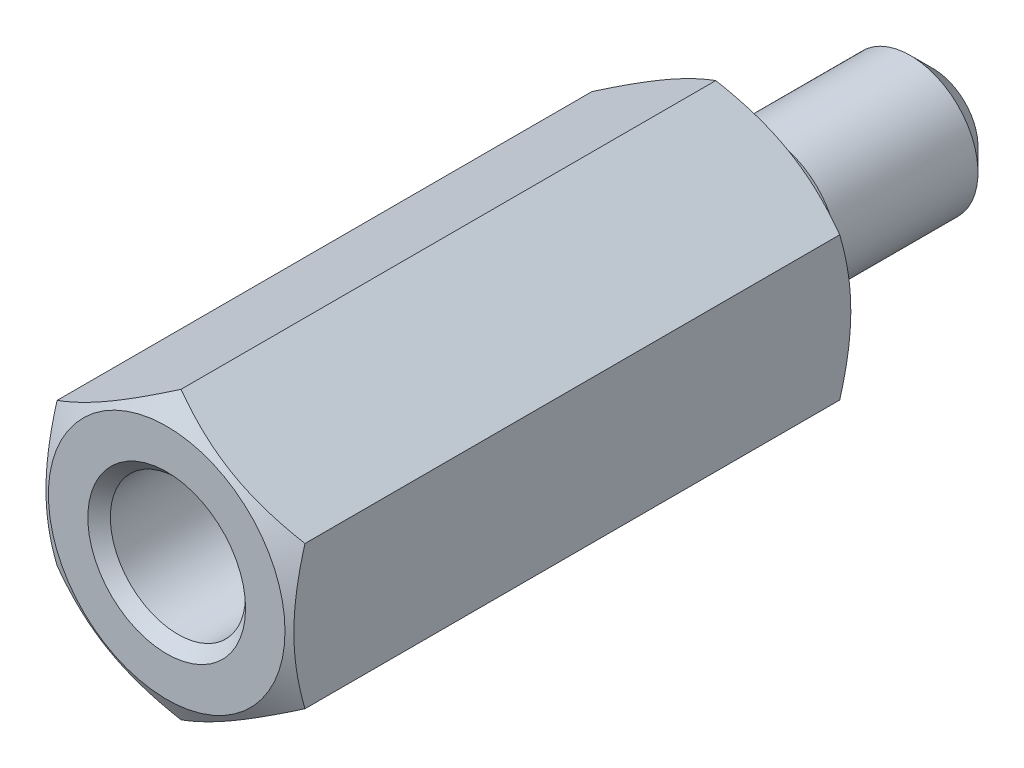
ISO-10303-21;
HEADER;
FILE_DESCRIPTION(('STEP AP214'),'2;1');
FILE_NAME('part.step','',(''),(''),'','','');
FILE_SCHEMA(('AUTOMOTIVE_DESIGN { 1 0 10303 214 1 1 1 1 }'));
ENDSEC;
DATA;
#1=APPLICATION_CONTEXT('core data for automotive mechanical design processes');
#2=APPLICATION_PROTOCOL_DEFINITION('international standard','automotive_design',2000,#1);
#3=PRODUCT_CONTEXT('',#1,'mechanical');
#4=PRODUCT('Part','Part','',(#3));
#5=PRODUCT_RELATED_PRODUCT_CATEGORY('part','',(#4));
#6=PRODUCT_DEFINITION_FORMATION('','',#4);
#7=PRODUCT_DEFINITION_CONTEXT('part definition',#1,'design');
#8=PRODUCT_DEFINITION('design','',#6,#7);
#9=PRODUCT_DEFINITION_SHAPE('','',#8);
#10=(LENGTH_UNIT() NAMED_UNIT(*) SI_UNIT(.MILLI.,.METRE.));
#11=(NAMED_UNIT(*) PLANE_ANGLE_UNIT() SI_UNIT($,.RADIAN.));
#12=(NAMED_UNIT(*) SI_UNIT($,.STERADIAN.) SOLID_ANGLE_UNIT());
#13=UNCERTAINTY_MEASURE_WITH_UNIT(LENGTH_MEASURE(1.E-05),#10,'distance_accuracy_value','');
#14=(GEOMETRIC_REPRESENTATION_CONTEXT(3) GLOBAL_UNCERTAINTY_ASSIGNED_CONTEXT((#13)) GLOBAL_UNIT_ASSIGNED_CONTEXT((#10,
#11,#12)) REPRESENTATION_CONTEXT('',''));
#15=CARTESIAN_POINT('',(0.,0.,0.));
#16=DIRECTION('',(0.,0.,1.));
#17=DIRECTION('',(1.,0.,0.));
#18=AXIS2_PLACEMENT_3D('',#15,#16,#17);
#19=CARTESIAN_POINT('',(0.,-12.7017059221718,0.));
#20=DIRECTION('',(0.,0.,-1.));
#21=DIRECTION('',(-1.,0.,0.));
#22=AXIS2_PLACEMENT_3D('',#19,#20,#21);
#23=PLANE('',#22);
#24=CARTESIAN_POINT('',(0.,0.,0.));
#25=DIRECTION('',(0.,0.,-1.));
#26=DIRECTION('',(-1.,0.,0.));
#27=AXIS2_PLACEMENT_3D('',#24,#25,#26);
#28=CIRCLE('',#27,5.1);
#29=CARTESIAN_POINT('',(-5.1,0.,0.));
#30=VERTEX_POINT('',#29);
#31=EDGE_CURVE('E23',#30,#30,#28,.F.);
#32=ORIENTED_EDGE('',*,*,#31,.T.);
#33=EDGE_LOOP('',(#32));
#34=FACE_BOUND('',#33,.T.);
#35=CARTESIAN_POINT('',(0.,0.,0.));
#36=DIRECTION('',(0.,0.,-1.));
#37=DIRECTION('',(-1.,0.,0.));
#38=AXIS2_PLACEMENT_3D('',#35,#36,#37);
#39=CIRCLE('',#38,10.5);
#40=CARTESIAN_POINT('',(-10.5,0.,0.));
#41=VERTEX_POINT('',#40);
#42=EDGE_CURVE('E73',#41,#41,#39,.T.);
#43=ORIENTED_EDGE('',*,*,#42,.T.);
#44=EDGE_LOOP('',(#43));
#45=FACE_BOUND('',#44,.T.);
#46=ADVANCED_FACE('F14',(#34,#45),#23,.T.);
#47=CARTESIAN_POINT('',(0.,0.,-18.));
#48=DIRECTION('',(0.,0.,1.));
#49=DIRECTION('',(1.,0.,0.));
#50=AXIS2_PLACEMENT_3D('',#47,#48,#49);
#51=CYLINDRICAL_SURFACE('',#50,6.);
#52=CARTESIAN_POINT('',(0.,0.,-3.5));
#53=DIRECTION('',(0.,0.,-1.));
#54=DIRECTION('',(-1.,0.,0.));
#55=AXIS2_PLACEMENT_3D('',#52,#53,#54);
#56=CIRCLE('',#55,6.);
#57=CARTESIAN_POINT('',(-6.,0.,-3.5));
#58=VERTEX_POINT('',#57);
#59=EDGE_CURVE('E233',#58,#58,#56,.T.);
#60=ORIENTED_EDGE('',*,*,#59,.T.);
#61=EDGE_LOOP('',(#60));
#62=FACE_BOUND('',#61,.T.);
#63=CARTESIAN_POINT('',(0.,0.,-16.));
#64=DIRECTION('',(0.,0.,-1.));
#65=DIRECTION('',(-1.,0.,0.));
#66=AXIS2_PLACEMENT_3D('',#63,#64,#65);
#67=CIRCLE('',#66,6.);
#68=CARTESIAN_POINT('',(-6.,0.,-16.));
#69=VERTEX_POINT('',#68);
#70=EDGE_CURVE('E85',#69,#69,#67,.F.);
#71=ORIENTED_EDGE('',*,*,#70,.T.);
#72=EDGE_LOOP('',(#71));
#73=FACE_BOUND('',#72,.T.);
#74=ADVANCED_FACE('F209',(#62,#73),#51,.T.);
#75=CARTESIAN_POINT('',(0.,0.,-18.));
#76=DIRECTION('',(0.,0.,-1.));
#77=DIRECTION('',(-1.,0.,0.));
#78=AXIS2_PLACEMENT_3D('',#75,#76,#77);
#79=PLANE('',#78);
#80=CARTESIAN_POINT('',(0.,0.,-18.));
#81=DIRECTION('',(0.,0.,-1.));
#82=DIRECTION('',(-1.,0.,0.));
#83=AXIS2_PLACEMENT_3D('',#80,#81,#82);
#84=CIRCLE('',#83,4.);
#85=CARTESIAN_POINT('',(-4.,0.,-18.));
#86=VERTEX_POINT('',#85);
#87=EDGE_CURVE('E82',#86,#86,#84,.T.);
#88=ORIENTED_EDGE('',*,*,#87,.T.);
#89=EDGE_LOOP('',(#88));
#90=FACE_BOUND('',#89,.T.);
#91=ADVANCED_FACE('F213',(#90),#79,.T.);
#92=CARTESIAN_POINT('',(0.,0.,-18.));
#93=DIRECTION('',(0.,0.,1.));
#94=DIRECTION('',(1.,0.,0.));
#95=AXIS2_PLACEMENT_3D('',#92,#93,#94);
#96=CONICAL_SURFACE('',#95,4.,0.785398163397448);
#97=ORIENTED_EDGE('',*,*,#70,.F.);
#98=EDGE_LOOP('',(#97));
#99=FACE_BOUND('',#98,.T.);
#100=ORIENTED_EDGE('',*,*,#87,.F.);
#101=EDGE_LOOP('',(#100));
#102=FACE_BOUND('',#101,.T.);
#103=ADVANCED_FACE('F216',(#99,#102),#96,.T.);
#104=CARTESIAN_POINT('',(0.,0.,-3.5));
#105=DIRECTION('',(0.,0.,-1.));
#106=DIRECTION('',(-1.,0.,0.));
#107=AXIS2_PLACEMENT_3D('',#104,#105,#106);
#108=PLANE('',#107);
#109=CARTESIAN_POINT('',(0.,0.,-3.5));
#110=DIRECTION('',(0.,0.,-1.));
#111=DIRECTION('',(-1.,0.,0.));
#112=AXIS2_PLACEMENT_3D('',#109,#110,#111);
#113=CIRCLE('',#112,5.1);
#114=CARTESIAN_POINT('',(-5.1,0.,-3.5));
#115=VERTEX_POINT('',#114);
#116=EDGE_CURVE('E93',#115,#115,#113,.T.);
#117=ORIENTED_EDGE('',*,*,#116,.T.);
#118=EDGE_LOOP('',(#117));
#119=FACE_BOUND('',#118,.T.);
#120=ORIENTED_EDGE('',*,*,#59,.F.);
#121=EDGE_LOOP('',(#120));
#122=FACE_BOUND('',#121,.T.);
#123=ADVANCED_FACE('F218',(#119,#122),#108,.F.);
#124=CARTESIAN_POINT('',(0.,0.,-3.5));
#125=DIRECTION('',(0.,0.,1.));
#126=DIRECTION('',(1.,0.,0.));
#127=AXIS2_PLACEMENT_3D('',#124,#125,#126);
#128=CYLINDRICAL_SURFACE('',#127,4.7);
#129=CARTESIAN_POINT('',(0.,0.,-3.1));
#130=DIRECTION('',(0.,0.,-1.));
#131=DIRECTION('',(-1.,0.,0.));
#132=AXIS2_PLACEMENT_3D('',#129,#130,#131);
#133=CIRCLE('',#132,4.7);
#134=CARTESIAN_POINT('',(-4.7,0.,-3.1));
#135=VERTEX_POINT('',#134);
#136=EDGE_CURVE('E99',#135,#135,#133,.F.);
#137=ORIENTED_EDGE('',*,*,#136,.T.);
#138=EDGE_LOOP('',(#137));
#139=FACE_BOUND('',#138,.T.);
#140=CARTESIAN_POINT('',(0.,0.,-0.4));
#141=DIRECTION('',(0.,0.,-1.));
#142=DIRECTION('',(-1.,0.,0.));
#143=AXIS2_PLACEMENT_3D('',#140,#141,#142);
#144=CIRCLE('',#143,4.7);
#145=CARTESIAN_POINT('',(-4.7,0.,-0.4));
#146=VERTEX_POINT('',#145);
#147=EDGE_CURVE('E96',#146,#146,#144,.T.);
#148=ORIENTED_EDGE('',*,*,#147,.T.);
#149=EDGE_LOOP('',(#148));
#150=FACE_BOUND('',#149,.T.);
#151=ADVANCED_FACE('F121',(#139,#150),#128,.T.);
#152=CARTESIAN_POINT('',(0.,0.,-3.1));
#153=DIRECTION('',(0.,0.,-1.));
#154=DIRECTION('',(-1.,0.,0.));
#155=AXIS2_PLACEMENT_3D('',#152,#153,#154);
#156=TOROIDAL_SURFACE('',#155,5.1,0.4);
#157=ORIENTED_EDGE('',*,*,#136,.F.);
#158=EDGE_LOOP('',(#157));
#159=FACE_BOUND('',#158,.T.);
#160=ORIENTED_EDGE('',*,*,#116,.F.);
#161=EDGE_LOOP('',(#160));
#162=FACE_BOUND('',#161,.T.);
#163=ADVANCED_FACE('F226',(#159,#162),#156,.F.);
#164=CARTESIAN_POINT('',(0.,0.,-0.4));
#165=DIRECTION('',(0.,0.,-1.));
#166=DIRECTION('',(-1.,0.,0.));
#167=AXIS2_PLACEMENT_3D('',#164,#165,#166);
#168=TOROIDAL_SURFACE('',#167,5.1,0.4);
#169=ORIENTED_EDGE('',*,*,#31,.F.);
#170=EDGE_LOOP('',(#169));
#171=FACE_BOUND('',#170,.T.);
#172=ORIENTED_EDGE('',*,*,#147,.F.);
#173=EDGE_LOOP('',(#172));
#174=FACE_BOUND('',#173,.T.);
#175=ADVANCED_FACE('F16',(#171,#174),#168,.F.);
#176=CARTESIAN_POINT('',(0.,0.,0.));
#177=DIRECTION('',(0.,0.,1.));
#178=DIRECTION('',(-1.,0.,0.));
#179=AXIS2_PLACEMENT_3D('',#176,#177,#178);
#180=CONICAL_SURFACE('',#179,10.5,1.0471975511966);
#181=ORIENTED_EDGE('',*,*,#42,.F.);
#182=EDGE_LOOP('',(#181));
#183=FACE_BOUND('',#182,.T.);
#184=CARTESIAN_POINT('',(11.,-62.8749634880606,30.7900542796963));
#185=CARTESIAN_POINT('',(11.,-61.8975224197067,30.2341743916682));
#186=CARTESIAN_POINT('',(11.,-60.9199185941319,29.6785806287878));
#187=CARTESIAN_POINT('',(11.,-58.9643277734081,28.56806278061));
#188=CARTESIAN_POINT('',(11.,-57.9863407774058,28.0131386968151));
#189=CARTESIAN_POINT('',(11.,-55.0495621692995,26.3482946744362));
#190=CARTESIAN_POINT('',(11.,-53.0901139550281,25.2395325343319));
#191=CARTESIAN_POINT('',(11.,-49.1256388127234,23.0018305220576));
#192=CARTESIAN_POINT('',(11.,-47.1205589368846,21.8729843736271));
#193=CARTESIAN_POINT('',(11.,-44.1113834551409,20.1850972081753));
#194=CARTESIAN_POINT('',(11.,-43.1086232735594,19.6236756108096));
#195=CARTESIAN_POINT('',(11.,-41.1020135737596,18.5027775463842));
#196=CARTESIAN_POINT('',(11.,-40.0981640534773,17.9433010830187));
#197=CARTESIAN_POINT('',(11.,-37.7045915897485,16.6130234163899));
#198=CARTESIAN_POINT('',(11.,-36.3142617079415,15.8433135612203));
#199=CARTESIAN_POINT('',(11.,-33.530155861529,14.3101526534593));
#200=CARTESIAN_POINT('',(11.,-32.1363799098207,13.54670157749));
#201=CARTESIAN_POINT('',(11.,-30.0393067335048,12.4067577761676));
#202=CARTESIAN_POINT('',(11.,-29.3378336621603,12.0269097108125));
#203=CARTESIAN_POINT('',(11.,-27.9333971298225,11.2699800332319));
#204=CARTESIAN_POINT('',(11.,-27.2304336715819,10.8928984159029));
#205=CARTESIAN_POINT('',(11.,-25.8229451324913,10.1422644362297));
#206=CARTESIAN_POINT('',(11.,-25.118420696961,9.76871086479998));
#207=CARTESIAN_POINT('',(11.,-23.7071447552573,9.02583730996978));
#208=CARTESIAN_POINT('',(11.,-23.000393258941,8.65651730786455));
#209=CARTESIAN_POINT('',(11.,-21.5961260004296,7.92945911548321));
#210=CARTESIAN_POINT('',(11.,-20.8986569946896,7.57163073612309));
#211=CARTESIAN_POINT('',(11.,-19.5003260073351,6.86261439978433));
#212=CARTESIAN_POINT('',(11.,-18.7994639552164,6.5114265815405));
#213=CARTESIAN_POINT('',(11.,-17.3923923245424,5.81723707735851));
#214=CARTESIAN_POINT('',(11.,-16.6861763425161,5.47424834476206));
#215=CARTESIAN_POINT('',(11.,-15.2682152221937,4.79993122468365));
#216=CARTESIAN_POINT('',(11.,-14.556470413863,4.4686021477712));
#217=CARTESIAN_POINT('',(11.,-13.4860218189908,3.98478409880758));
#218=CARTESIAN_POINT('',(11.,-13.1300432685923,3.82626442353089));
#219=CARTESIAN_POINT('',(11.,-12.4160437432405,3.5138994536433));
#220=CARTESIAN_POINT('',(11.,-12.0580228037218,3.3600540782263));
#221=CARTESIAN_POINT('',(11.,-11.3395276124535,3.05784260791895));
#222=CARTESIAN_POINT('',(11.,-10.9790525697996,2.90947838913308));
#223=CARTESIAN_POINT('',(11.,-10.2554541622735,2.61934580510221));
#224=CARTESIAN_POINT('',(11.,-9.89233082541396,2.47757737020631));
#225=CARTESIAN_POINT('',(11.,-9.16404537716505,2.20228741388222));
#226=CARTESIAN_POINT('',(11.,-8.79889107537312,2.06874530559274));
#227=CARTESIAN_POINT('',(11.,-8.06524458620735,1.81105549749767));
#228=CARTESIAN_POINT('',(11.,-7.69675222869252,1.68690827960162));
#229=CARTESIAN_POINT('',(11.,-6.95641036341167,1.4499633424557));
#230=CARTESIAN_POINT('',(11.,-6.58456343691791,1.33715759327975));
#231=CARTESIAN_POINT('',(11.,-5.83706477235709,1.12497419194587));
#232=CARTESIAN_POINT('',(11.,-5.46141355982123,1.02559471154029));
#233=CARTESIAN_POINT('',(11.,-4.94889005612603,0.901454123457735));
#234=CARTESIAN_POINT('',(11.,-4.81367618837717,0.869775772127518));
#235=CARTESIAN_POINT('',(11.,-4.542747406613,0.808557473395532));
#236=CARTESIAN_POINT('',(11.,-4.4070324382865,0.779017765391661));
#237=CARTESIAN_POINT('',(11.,-4.13508874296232,0.722188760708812));
#238=CARTESIAN_POINT('',(11.,-3.99885987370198,0.694900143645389));
#239=CARTESIAN_POINT('',(11.,-3.72595257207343,0.642699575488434));
#240=CARTESIAN_POINT('',(11.,-3.58927415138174,0.6177875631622));
#241=CARTESIAN_POINT('',(11.,-3.17872151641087,0.54680922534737));
#242=CARTESIAN_POINT('',(11.,-2.90418987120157,0.504471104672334));
#243=CARTESIAN_POINT('',(11.,-2.35368683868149,0.430592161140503));
#244=CARTESIAN_POINT('',(11.,-2.07771551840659,0.399050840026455));
#245=CARTESIAN_POINT('',(11.,-1.53076779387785,0.348023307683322));
#246=CARTESIAN_POINT('',(11.,-1.25981484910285,0.328287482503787));
#247=CARTESIAN_POINT('',(11.,-0.717320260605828,0.300252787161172));
#248=CARTESIAN_POINT('',(11.,-0.445778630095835,0.291953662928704));
#249=CARTESIAN_POINT('',(11.,0.0975617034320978,0.286987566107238));
#250=CARTESIAN_POINT('',(11.,0.369360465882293,0.290326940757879));
#251=CARTESIAN_POINT('',(11.,0.912573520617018,0.308568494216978));
#252=CARTESIAN_POINT('',(11.,1.18398779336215,0.32347124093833));
#253=CARTESIAN_POINT('',(11.,1.83044824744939,0.372419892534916));
#254=CARTESIAN_POINT('',(11.,2.20511228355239,0.411630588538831));
#255=CARTESIAN_POINT('',(11.,2.95178997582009,0.510004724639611));
#256=CARTESIAN_POINT('',(11.,3.32380330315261,0.569170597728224));
#257=CARTESIAN_POINT('',(11.,4.43509822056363,0.773436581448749));
#258=CARTESIAN_POINT('',(11.,5.16953333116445,0.945296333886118));
#259=CARTESIAN_POINT('',(11.,6.26991664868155,1.24542680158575));
#260=CARTESIAN_POINT('',(11.,6.64148347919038,1.35429085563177));
#261=CARTESIAN_POINT('',(11.,7.3810025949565,1.58378042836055));
#262=CARTESIAN_POINT('',(11.,7.74895484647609,1.70440605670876));
#263=CARTESIAN_POINT('',(11.,8.48142665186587,1.95546336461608));
#264=CARTESIAN_POINT('',(11.,8.84594656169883,2.08589401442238));
#265=CARTESIAN_POINT('',(11.,9.39042739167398,2.28768845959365));
#266=CARTESIAN_POINT('',(11.,9.57153518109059,2.35597696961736));
#267=CARTESIAN_POINT('',(11.,9.93303020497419,2.49443365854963));
#268=CARTESIAN_POINT('',(11.,10.1134174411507,2.56460183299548));
#269=CARTESIAN_POINT('',(11.,10.7171388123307,2.80275755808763));
#270=CARTESIAN_POINT('',(11.,11.1389411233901,2.97463654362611));
#271=CARTESIAN_POINT('',(11.,11.9793233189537,3.32611884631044));
#272=CARTESIAN_POINT('',(11.,12.3979030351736,3.50572256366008));
#273=CARTESIAN_POINT('',(11.,13.2323637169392,3.87129415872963));
#274=CARTESIAN_POINT('',(11.,13.6482441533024,4.05726324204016));
#275=CARTESIAN_POINT('',(11.,14.4776152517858,4.43442637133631));
#276=CARTESIAN_POINT('',(11.,14.8911059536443,4.62562033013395));
#277=CARTESIAN_POINT('',(11.,15.7163336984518,5.01249448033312));
#278=CARTESIAN_POINT('',(11.,16.1280693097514,5.20817772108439));
#279=CARTESIAN_POINT('',(11.,16.949782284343,5.6032048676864));
#280=CARTESIAN_POINT('',(11.,17.3597596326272,5.80254880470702));
#281=CARTESIAN_POINT('',(11.,18.5873396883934,6.40515151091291));
#282=CARTESIAN_POINT('',(11.,19.4026783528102,6.81302271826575));
#283=CARTESIAN_POINT('',(11.,21.0307028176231,7.63866544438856));
#284=CARTESIAN_POINT('',(11.,21.8433779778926,8.05645785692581));
#285=CARTESIAN_POINT('',(11.,23.4652382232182,8.89879390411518));
#286=CARTESIAN_POINT('',(11.,24.2744232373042,9.32333767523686));
#287=CARTESIAN_POINT('',(11.,25.8897342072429,10.1774163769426));
#288=CARTESIAN_POINT('',(11.,26.6958612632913,10.6069492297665));
#289=CARTESIAN_POINT('',(11.,28.3059423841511,11.4700518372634));
#290=CARTESIAN_POINT('',(11.,29.1098964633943,11.9036215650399));
#291=CARTESIAN_POINT('',(11.,31.2773812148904,13.0781090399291));
#292=CARTESIAN_POINT('',(11.,32.6392788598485,13.822039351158));
#293=CARTESIAN_POINT('',(11.,35.3596935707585,15.3164222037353));
#294=CARTESIAN_POINT('',(11.,36.718210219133,16.0668755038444));
#295=CARTESIAN_POINT('',(11.,39.426834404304,17.5692606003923));
#296=CARTESIAN_POINT('',(11.,40.7769530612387,18.3211723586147));
#297=CARTESIAN_POINT('',(11.,42.8005782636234,19.451613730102));
#298=CARTESIAN_POINT('',(11.,43.4748179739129,19.828832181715));
#299=CARTESIAN_POINT('',(11.,44.8228650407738,20.5840396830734));
#300=CARTESIAN_POINT('',(11.,45.4966723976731,20.9620287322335));
#301=CARTESIAN_POINT('',(11.,46.1702922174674,21.3403517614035));
#302=B_SPLINE_CURVE_WITH_KNOTS('',3,(#184,#185,#186,#187,#188,#189,#190,#191,#192,#193,#194,
#195,#196,#197,#198,#199,#200,#201,#202,#203,#204,#205,#206,#207,#208,#209,#210,#211,#212,#213,
#214,#215,#216,#217,#218,#219,#220,#221,#222,#223,#224,#225,#226,#227,#228,#229,#230,#231,#232,
#233,#234,#235,#236,#237,#238,#239,#240,#241,#242,#243,#244,#245,#246,#247,#248,#249,#250,#251,
#252,#253,#254,#255,#256,#257,#258,#259,#260,#261,#262,#263,#264,#265,#266,#267,#268,#269,#270,
#271,#272,#273,#274,#275,#276,#277,#278,#279,#280,#281,#282,#283,#284,#285,#286,#287,#288,#289,
#290,#291,#292,#293,#294,#295,#296,#297,#298,#299,#300,#301),.UNSPECIFIED.,.F.,.F.,(4,2,2,2,2,2,
2,2,2,2,2,2,2,2,2,2,2,2,2,2,2,2,2,2,2,2,2,2,2,2,2,2,2,2,2,2,2,2,2,2,2,2,2,2,2,2,2,2,2,2,2,2,2,2,
2,2,2,2,4),(0.,3.37335756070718,6.74672267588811,13.5009118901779,20.4039273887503,
23.8516060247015,27.299291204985,32.0667996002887,36.8342901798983,39.2274300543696,
41.6205655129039,44.0128486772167,46.4051212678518,48.7568041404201,51.1085360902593,
53.4637660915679,55.8188565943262,56.9878653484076,58.1568538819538,59.3262389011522,
60.4956115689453,61.6619277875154,62.8283037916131,63.993848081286,65.159233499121,
65.5758458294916,65.9925047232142,66.4092889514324,66.8260624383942,67.6591802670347,
68.4922596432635,69.307037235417,70.1217967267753,70.9370006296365,71.7522445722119,
72.881744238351,74.0113816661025,76.2709605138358,77.4324142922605,78.5938789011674,
79.7552216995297,80.3358760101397,80.9165289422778,82.2828537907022,83.6492495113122,
85.0159054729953,86.3825386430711,87.7501293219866,89.1177316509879,91.8526445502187,
94.593943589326,97.3352981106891,100.075549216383,102.815782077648,107.47126434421,
112.127295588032,116.763420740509,119.081185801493,121.39894910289),.UNSPECIFIED.);
#303=CARTESIAN_POINT('',(11.,6.35085296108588,1.2711555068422));
#304=VERTEX_POINT('',#303);
#305=CARTESIAN_POINT('',(11.,-6.35085296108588,1.2711555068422));
#306=VERTEX_POINT('',#305);
#307=EDGE_CURVE('E30',#304,#306,#302,.F.);
#308=ORIENTED_EDGE('',*,*,#307,.T.);
#309=CARTESIAN_POINT('',(11.0002,-6.35073749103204,1.271222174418));
#310=CARTESIAN_POINT('',(10.7583962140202,-6.49034297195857,1.19063428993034));
#311=CARTESIAN_POINT('',(10.515690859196,-6.63046897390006,1.11370405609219));
#312=CARTESIAN_POINT('',(10.0283338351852,-6.91184468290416,0.968173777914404));
#313=CARTESIAN_POINT('',(9.78368155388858,-7.05309474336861,0.899576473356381));
#314=CARTESIAN_POINT('',(9.0457826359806,-7.47912088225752,0.707611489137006));
#315=CARTESIAN_POINT('',(8.54962304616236,-7.7655787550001,0.598422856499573));
#316=CARTESIAN_POINT('',(7.80714296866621,-8.19424982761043,0.470389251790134));
#317=CARTESIAN_POINT('',(7.56304065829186,-8.33518236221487,0.433917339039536));
#318=CARTESIAN_POINT('',(7.07370581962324,-8.61769996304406,0.372756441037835));
#319=CARTESIAN_POINT('',(6.82847326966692,-8.7592850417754,0.348067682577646));
#320=CARTESIAN_POINT('',(6.33759931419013,-9.0426912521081,0.311105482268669));
#321=CARTESIAN_POINT('',(6.0919587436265,-9.18451190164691,0.298817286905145));
#322=CARTESIAN_POINT('',(5.60044998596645,-9.468284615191,0.286918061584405));
#323=CARTESIAN_POINT('',(5.35458180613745,-9.61023667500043,0.287306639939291));
#324=CARTESIAN_POINT('',(4.89492981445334,-9.87561687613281,0.299876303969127));
#325=CARTESIAN_POINT('',(4.68111322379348,-9.99906394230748,0.31052416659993));
#326=CARTESIAN_POINT('',(4.25397181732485,-10.2456741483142,0.341206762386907));
#327=CARTESIAN_POINT('',(4.04064703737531,-10.3688372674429,0.361242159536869));
#328=CARTESIAN_POINT('',(3.6146051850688,-10.6148126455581,0.410350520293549));
#329=CARTESIAN_POINT('',(3.4018887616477,-10.7376245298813,0.439430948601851));
#330=CARTESIAN_POINT('',(2.97745318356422,-10.9826725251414,0.50611913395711));
#331=CARTESIAN_POINT('',(2.76573409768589,-11.1049085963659,0.543727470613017));
#332=CARTESIAN_POINT('',(2.12304886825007,-11.4759630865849,0.67029505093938));
#333=CARTESIAN_POINT('',(1.69394387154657,-11.7237069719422,0.771874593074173));
#334=CARTESIAN_POINT('',(0.84213249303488,-12.2155005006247,1.00241883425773));
#335=CARTESIAN_POINT('',(0.419415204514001,-12.4595564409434,1.13132938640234));
#336=CARTESIAN_POINT('',(-0.000199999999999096,-12.7018213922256,1.271222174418));
#337=B_SPLINE_CURVE_WITH_KNOTS('',3,(#309,#310,#311,#312,#313,#314,#315,#316,#317,#318,#319,
#320,#321,#322,#323,#324,#325,#326,#327,#328,#329,#330,#331,#332,#333,#334,#335,#336),
.UNSPECIFIED.,.F.,.F.,(4,2,2,2,2,2,2,2,2,2,2,2,2,4),(0.,0.871755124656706,1.74379610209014,
3.49159027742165,4.34403665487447,5.19649943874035,6.0479468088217,6.89936787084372,
7.64056020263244,8.38180496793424,9.1236630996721,9.86557166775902,11.3820155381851,
12.8954827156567),.UNSPECIFIED.);
#338=CARTESIAN_POINT('',(0.,-12.7017059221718,1.2711555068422));
#339=VERTEX_POINT('',#338);
#340=EDGE_CURVE('E67',#306,#339,#337,.T.);
#341=ORIENTED_EDGE('',*,*,#340,.T.);
#342=CARTESIAN_POINT('',(0.000200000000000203,-12.7018213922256,1.271222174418));
#343=CARTESIAN_POINT('',(-0.241603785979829,-12.5622159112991,1.19063428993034));
#344=CARTESIAN_POINT('',(-0.484309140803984,-12.4220899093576,1.11370405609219));
#345=CARTESIAN_POINT('',(-0.971666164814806,-12.1407142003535,0.968173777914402));
#346=CARTESIAN_POINT('',(-1.21631844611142,-11.999464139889,0.89957647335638));
#347=CARTESIAN_POINT('',(-1.9542173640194,-11.5734380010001,0.707611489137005));
#348=CARTESIAN_POINT('',(-2.45037695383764,-11.2869801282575,0.598422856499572));
#349=CARTESIAN_POINT('',(-3.19285703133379,-10.8583090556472,0.470389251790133));
#350=CARTESIAN_POINT('',(-3.43695934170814,-10.7173765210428,0.433917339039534));
#351=CARTESIAN_POINT('',(-3.92629418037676,-10.4348589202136,0.372756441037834));
#352=CARTESIAN_POINT('',(-4.17152673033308,-10.2932738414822,0.348067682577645));
#353=CARTESIAN_POINT('',(-4.66240068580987,-10.0098676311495,0.311105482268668));
#354=CARTESIAN_POINT('',(-4.9080412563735,-9.86804698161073,0.298817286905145));
#355=CARTESIAN_POINT('',(-5.39955001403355,-9.58427426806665,0.286918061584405));
#356=CARTESIAN_POINT('',(-5.64541819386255,-9.44232220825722,0.287306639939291));
#357=CARTESIAN_POINT('',(-6.10507018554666,-9.17694200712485,0.299876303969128));
#358=CARTESIAN_POINT('',(-6.31888677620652,-9.05349494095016,0.310524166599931));
#359=CARTESIAN_POINT('',(-6.74602818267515,-8.80688473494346,0.341206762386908));
#360=CARTESIAN_POINT('',(-6.95935296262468,-8.68372161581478,0.361242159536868));
#361=CARTESIAN_POINT('',(-7.3853948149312,-8.43774623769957,0.410350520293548));
#362=CARTESIAN_POINT('',(-7.5981112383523,-8.31493435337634,0.43943094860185));
#363=CARTESIAN_POINT('',(-8.02254681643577,-8.06988635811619,0.50611913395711));
#364=CARTESIAN_POINT('',(-8.23426590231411,-7.94765028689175,0.543727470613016));
#365=CARTESIAN_POINT('',(-8.87695113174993,-7.57659579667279,0.670295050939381));
#366=CARTESIAN_POINT('',(-9.30605612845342,-7.32885191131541,0.771874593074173));
#367=CARTESIAN_POINT('',(-10.1578675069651,-6.8370583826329,1.00241883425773));
#368=CARTESIAN_POINT('',(-10.580584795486,-6.59300244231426,1.13132938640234));
#369=CARTESIAN_POINT('',(-11.0002,-6.35073749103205,1.271222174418));
#370=B_SPLINE_CURVE_WITH_KNOTS('',3,(#342,#343,#344,#345,#346,#347,#348,#349,#350,#351,#352,
#353,#354,#355,#356,#357,#358,#359,#360,#361,#362,#363,#364,#365,#366,#367,#368,#369),
.UNSPECIFIED.,.F.,.F.,(4,2,2,2,2,2,2,2,2,2,2,2,2,4),(0.,0.871755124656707,1.74379610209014,
3.49159027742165,4.34403665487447,5.19649943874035,6.04794680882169,6.89936787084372,
7.64056020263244,8.38180496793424,9.12366309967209,9.86557166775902,11.3820155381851,
12.8954827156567),.UNSPECIFIED.);
#371=CARTESIAN_POINT('',(-11.,-6.35085296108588,1.27115550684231));
#372=VERTEX_POINT('',#371);
#373=EDGE_CURVE('E69',#339,#372,#370,.T.);
#374=ORIENTED_EDGE('',*,*,#373,.T.);
#375=CARTESIAN_POINT('',(-11.,-62.8749634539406,30.7900542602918));
#376=CARTESIAN_POINT('',(-11.,-61.8975223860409,30.234174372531));
#377=CARTESIAN_POINT('',(-11.,-60.9199185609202,29.6785806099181));
#378=CARTESIAN_POINT('',(-11.,-58.9643277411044,28.5680627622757));
#379=CARTESIAN_POINT('',(-11.,-57.9863407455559,28.0131386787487));
#380=CARTESIAN_POINT('',(-11.,-55.0495621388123,26.3482946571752));
#381=CARTESIAN_POINT('',(-11.,-53.0901139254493,25.2395325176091));
#382=CARTESIAN_POINT('',(-11.,-49.1256387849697,23.0018305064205));
#383=CARTESIAN_POINT('',(-11.,-47.1205589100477,21.8729843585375));
#384=CARTESIAN_POINT('',(-11.,-44.1113834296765,20.1850971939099));
#385=CARTESIAN_POINT('',(-11.,-43.1086232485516,19.6236755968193));
#386=CARTESIAN_POINT('',(-11.,-41.1020135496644,18.5027775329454));
#387=CARTESIAN_POINT('',(-11.,-40.098164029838,17.9433010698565));
#388=CARTESIAN_POINT('',(-11.,-37.7045915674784,16.6130234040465));
#389=CARTESIAN_POINT('',(-11.,-36.3142616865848,15.8433135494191));
#390=CARTESIAN_POINT('',(-11.,-33.5301558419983,14.3101526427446));
#391=CARTESIAN_POINT('',(-11.,-32.1363798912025,13.5467015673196));
#392=CARTESIAN_POINT('',(-11.,-30.0393067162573,12.4067577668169));
#393=CARTESIAN_POINT('',(-11.,-29.3378336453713,12.0269097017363));
#394=CARTESIAN_POINT('',(-11.,-27.9333971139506,11.2699800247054));
#395=CARTESIAN_POINT('',(-11.,-27.2304336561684,10.8928984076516));
#396=CARTESIAN_POINT('',(-11.,-25.8229451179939,10.1422644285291));
#397=CARTESIAN_POINT('',(-11.,-25.1184206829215,9.76871085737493));
#398=CARTESIAN_POINT('',(-11.,-23.7071447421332,9.02583730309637));
#399=CARTESIAN_POINT('',(-11.,-23.0003932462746,8.65651730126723));
#400=CARTESIAN_POINT('',(-11.,-21.59612598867,7.92945910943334));
#401=CARTESIAN_POINT('',(-11.,-20.898656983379,7.57163073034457));
#402=CARTESIAN_POINT('',(-11.,-19.5003259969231,6.86261439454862));
#403=CARTESIAN_POINT('',(-11.,-18.7994639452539,6.51142657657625));
#404=CARTESIAN_POINT('',(-11.,-17.3923923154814,5.81723707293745));
#405=CARTESIAN_POINT('',(-11.,-16.686176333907,5.47424834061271));
#406=CARTESIAN_POINT('',(-11.,-15.2682152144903,4.79993122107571));
#407=CARTESIAN_POINT('',(-11.,-14.5564704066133,4.46860214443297));
#408=CARTESIAN_POINT('',(-11.,-13.4860218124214,3.98478409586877));
#409=CARTESIAN_POINT('',(-11.,-13.1300432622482,3.82626442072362));
#410=CARTESIAN_POINT('',(-11.,-12.4160437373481,3.51389945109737));
#411=CARTESIAN_POINT('',(-11.,-12.058022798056,3.36005407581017));
#412=CARTESIAN_POINT('',(-11.,-11.3395276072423,3.05784260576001));
#413=CARTESIAN_POINT('',(-11.,-10.9790525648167,2.90947838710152));
#414=CARTESIAN_POINT('',(-11.,-10.2554541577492,2.61934580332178));
#415=CARTESIAN_POINT('',(-11.,-9.89233082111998,2.47757736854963));
#416=CARTESIAN_POINT('',(-11.,-9.16404537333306,2.20228741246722));
#417=CARTESIAN_POINT('',(-11.,-8.79889107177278,2.06874530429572));
#418=CARTESIAN_POINT('',(-11.,-8.06524458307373,1.81105549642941));
#419=CARTESIAN_POINT('',(-11.,-7.69675222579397,1.68690827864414));
#420=CARTESIAN_POINT('',(-11.,-6.956410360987,1.44996334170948));
#421=CARTESIAN_POINT('',(-11.,-6.58456343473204,1.33715759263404));
#422=CARTESIAN_POINT('',(-11.,-5.83706477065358,1.12497419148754));
#423=CARTESIAN_POINT('',(-11.,-5.46141355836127,1.02559471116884));
#424=CARTESIAN_POINT('',(-11.,-4.94889005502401,0.901454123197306));
#425=CARTESIAN_POINT('',(-11.,-4.81367618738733,0.869775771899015));
#426=CARTESIAN_POINT('',(-11.,-4.54274740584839,0.808557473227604));
#427=CARTESIAN_POINT('',(-11.,-4.40703243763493,0.779017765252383));
#428=CARTESIAN_POINT('',(-11.,-4.13508874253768,0.722188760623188));
#429=CARTESIAN_POINT('',(-11.,-3.99885987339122,0.694900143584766));
#430=CARTESIAN_POINT('',(-11.,-3.72595257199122,0.642699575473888));
#431=CARTESIAN_POINT('',(-11.,-3.58927415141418,0.617787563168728));
#432=CARTESIAN_POINT('',(-11.,-3.17872151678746,0.546809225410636));
#433=CARTESIAN_POINT('',(-11.,-2.90418987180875,0.504471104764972));
#434=CARTESIAN_POINT('',(-11.,-2.353686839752,0.430592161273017));
#435=CARTESIAN_POINT('',(-11.,-2.07771551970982,0.399050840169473));
#436=CARTESIAN_POINT('',(-11.,-1.53076779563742,0.34802330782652));
#437=CARTESIAN_POINT('',(-11.,-1.259814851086,0.328287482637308));
#438=CARTESIAN_POINT('',(-11.,-0.7173202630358,0.30025278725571));
#439=CARTESIAN_POINT('',(-11.,-0.445778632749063,0.291953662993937));
#440=CARTESIAN_POINT('',(-11.,0.0975617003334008,0.286987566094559));
#441=CARTESIAN_POINT('',(-11.,0.369360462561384,0.290326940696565));
#442=CARTESIAN_POINT('',(-11.,0.912573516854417,0.30856849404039));
#443=CARTESIAN_POINT('',(-11.,1.18398778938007,0.323471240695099));
#444=CARTESIAN_POINT('',(-11.,1.83044824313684,0.372419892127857));
#445=CARTESIAN_POINT('',(-11.,2.20511227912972,0.411630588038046));
#446=CARTESIAN_POINT('',(-11.,2.95178997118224,0.510004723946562));
#447=CARTESIAN_POINT('',(-11.,3.32380329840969,0.569170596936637));
#448=CARTESIAN_POINT('',(-11.,4.4350982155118,0.773436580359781));
#449=CARTESIAN_POINT('',(-11.,5.16953332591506,0.945296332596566));
#450=CARTESIAN_POINT('',(-11.,6.26991664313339,1.24542679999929));
#451=CARTESIAN_POINT('',(-11.,6.64148347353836,1.3542908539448));
#452=CARTESIAN_POINT('',(-11.,7.38100258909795,1.58378042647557));
#453=CARTESIAN_POINT('',(-11.,7.74895484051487,1.70440605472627));
#454=CARTESIAN_POINT('',(-11.,8.48142664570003,1.95546336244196));
#455=CARTESIAN_POINT('',(-11.,8.84594655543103,2.08589401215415));
#456=CARTESIAN_POINT('',(-11.,9.39042738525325,2.28768845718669));
#457=CARTESIAN_POINT('',(-11.,9.57153517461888,2.35597696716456));
#458=CARTESIAN_POINT('',(-11.,9.93303019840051,2.49443365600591));
#459=CARTESIAN_POINT('',(-11.,10.1134174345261,2.56460183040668));
#460=CARTESIAN_POINT('',(-11.,10.7171388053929,2.80275755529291));
#461=CARTESIAN_POINT('',(-11.,11.1389411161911,2.97463654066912));
#462=CARTESIAN_POINT('',(-11.,11.979323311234,3.32611884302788));
#463=CARTESIAN_POINT('',(-11.,12.3979030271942,3.50572256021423));
#464=CARTESIAN_POINT('',(-11.,13.2323637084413,3.87129415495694));
#465=CARTESIAN_POINT('',(-11.,13.6482441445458,4.05726323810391));
#466=CARTESIAN_POINT('',(-11.,14.477615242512,4.43442636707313));
#467=CARTESIAN_POINT('',(-11.,14.8911059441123,4.62562032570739));
#468=CARTESIAN_POINT('',(-11.,15.7163336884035,5.01249447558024));
#469=CARTESIAN_POINT('',(-11.,16.1280692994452,5.20817771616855));
#470=CARTESIAN_POINT('',(-11.,16.949782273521,5.6032048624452));
#471=CARTESIAN_POINT('',(-11.,17.3597596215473,5.80254879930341));
#472=CARTESIAN_POINT('',(-11.,18.5873396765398,6.40515150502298));
#473=CARTESIAN_POINT('',(-11.,19.4026783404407,6.81302271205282));
#474=CARTESIAN_POINT('',(-11.,21.0307028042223,7.63866543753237));
#475=CARTESIAN_POINT('',(-11.,21.8433779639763,8.05645784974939));
#476=CARTESIAN_POINT('',(-11.,23.4652382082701,8.8987938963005));
#477=CARTESIAN_POINT('',(-11.,24.2744232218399,9.32333766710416));
#478=CARTESIAN_POINT('',(-11.,25.8897341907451,10.1774163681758));
#479=CARTESIAN_POINT('',(-11.,26.6958612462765,10.6069492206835));
#480=CARTESIAN_POINT('',(-11.,28.3059423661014,11.4700518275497));
#481=CARTESIAN_POINT('',(-11.,29.1098964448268,11.9036215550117));
#482=CARTESIAN_POINT('',(-11.,31.2773811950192,13.0781090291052));
#483=CARTESIAN_POINT('',(-11.,32.6392788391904,13.8220393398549));
#484=CARTESIAN_POINT('',(-11.,35.359693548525,15.3164221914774));
#485=CARTESIAN_POINT('',(-11.,36.7182101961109,16.066875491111));
#486=CARTESIAN_POINT('',(-11.,39.4268343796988,17.5692605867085));
#487=CARTESIAN_POINT('',(-11.,40.7769530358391,18.3211723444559));
#488=CARTESIAN_POINT('',(-11.,42.8005782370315,19.4516137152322));
#489=CARTESIAN_POINT('',(-11.,43.4748179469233,19.8288321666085));
#490=CARTESIAN_POINT('',(-11.,44.8228650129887,20.5840396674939));
#491=CARTESIAN_POINT('',(-11.,45.4966723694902,20.9620287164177));
#492=CARTESIAN_POINT('',(-11.,46.1702921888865,21.3403517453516));
#493=B_SPLINE_CURVE_WITH_KNOTS('',3,(#375,#376,#377,#378,#379,#380,#381,#382,#383,#384,#385,
#386,#387,#388,#389,#390,#391,#392,#393,#394,#395,#396,#397,#398,#399,#400,#401,#402,#403,#404,
#405,#406,#407,#408,#409,#410,#411,#412,#413,#414,#415,#416,#417,#418,#419,#420,#421,#422,#423,
#424,#425,#426,#427,#428,#429,#430,#431,#432,#433,#434,#435,#436,#437,#438,#439,#440,#441,#442,
#443,#444,#445,#446,#447,#448,#449,#450,#451,#452,#453,#454,#455,#456,#457,#458,#459,#460,#461,
#462,#463,#464,#465,#466,#467,#468,#469,#470,#471,#472,#473,#474,#475,#476,#477,#478,#479,#480,
#481,#482,#483,#484,#485,#486,#487,#488,#489,#490,#491,#492),.UNSPECIFIED.,.F.,.F.,(4,2,2,2,2,2,
2,2,2,2,2,2,2,2,2,2,2,2,2,2,2,2,2,2,2,2,2,2,2,2,2,2,2,2,2,2,2,2,2,2,2,2,2,2,2,2,2,2,2,2,2,2,2,2,
2,2,2,2,4),(0.,3.37335755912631,6.74672267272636,13.5009118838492,20.4039273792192,
23.851606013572,27.2992911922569,32.0667995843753,36.8342901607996,39.2274300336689,
41.6205654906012,44.0128486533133,46.4051212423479,48.7568041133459,51.1085360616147,
53.4637660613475,55.8188565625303,56.9878653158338,58.1568538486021,59.3262388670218,
60.4956115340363,61.6619277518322,62.8283037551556,63.9938480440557,65.1592334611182,
65.5758457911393,65.9925046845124,66.4092889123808,66.826062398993,67.6591802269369,
68.492259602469,69.3070371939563,70.1217966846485,70.9370005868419,71.7522445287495,
72.8817441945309,74.0113816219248,76.2709604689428,77.4324142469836,78.5938788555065,
79.7552216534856,80.335875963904,80.9165288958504,82.2828537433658,83.6492494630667,
85.0159054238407,86.3825385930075,87.7501292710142,89.1177315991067,91.8526444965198,
94.5939435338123,97.3352980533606,100.07554915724,102.81578201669,107.471264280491,
112.127295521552,116.763420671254,119.081185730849,121.398949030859),.UNSPECIFIED.);
#494=CARTESIAN_POINT('',(-11.,6.35085296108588,1.2711555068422));
#495=VERTEX_POINT('',#494);
#496=EDGE_CURVE('E78',#372,#495,#493,.T.);
#497=ORIENTED_EDGE('',*,*,#496,.T.);
#498=CARTESIAN_POINT('',(-11.0002,6.35073749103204,1.271222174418));
#499=CARTESIAN_POINT('',(-10.7583962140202,6.49034297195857,1.19063428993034));
#500=CARTESIAN_POINT('',(-10.515690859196,6.63046897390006,1.11370405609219));
#501=CARTESIAN_POINT('',(-10.0283338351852,6.91184468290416,0.968173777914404));
#502=CARTESIAN_POINT('',(-9.78368155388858,7.05309474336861,0.899576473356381));
#503=CARTESIAN_POINT('',(-9.0457826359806,7.47912088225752,0.707611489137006));
#504=CARTESIAN_POINT('',(-8.54962304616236,7.7655787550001,0.598422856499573));
#505=CARTESIAN_POINT('',(-7.80714296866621,8.19424982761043,0.470389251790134));
#506=CARTESIAN_POINT('',(-7.56304065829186,8.33518236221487,0.433917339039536));
#507=CARTESIAN_POINT('',(-7.07370581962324,8.61769996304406,0.372756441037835));
#508=CARTESIAN_POINT('',(-6.82847326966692,8.7592850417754,0.348067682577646));
#509=CARTESIAN_POINT('',(-6.33759931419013,9.0426912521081,0.311105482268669));
#510=CARTESIAN_POINT('',(-6.0919587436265,9.18451190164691,0.298817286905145));
#511=CARTESIAN_POINT('',(-5.60044998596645,9.468284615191,0.286918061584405));
#512=CARTESIAN_POINT('',(-5.35458180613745,9.61023667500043,0.287306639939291));
#513=CARTESIAN_POINT('',(-4.89492981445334,9.87561687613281,0.299876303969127));
#514=CARTESIAN_POINT('',(-4.68111322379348,9.99906394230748,0.31052416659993));
#515=CARTESIAN_POINT('',(-4.25397181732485,10.2456741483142,0.341206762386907));
#516=CARTESIAN_POINT('',(-4.04064703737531,10.3688372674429,0.361242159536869));
#517=CARTESIAN_POINT('',(-3.6146051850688,10.6148126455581,0.410350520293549));
#518=CARTESIAN_POINT('',(-3.4018887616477,10.7376245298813,0.439430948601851));
#519=CARTESIAN_POINT('',(-2.97745318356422,10.9826725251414,0.50611913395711));
#520=CARTESIAN_POINT('',(-2.76573409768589,11.1049085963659,0.543727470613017));
#521=CARTESIAN_POINT('',(-2.12304886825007,11.4759630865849,0.67029505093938));
#522=CARTESIAN_POINT('',(-1.69394387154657,11.7237069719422,0.771874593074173));
#523=CARTESIAN_POINT('',(-0.84213249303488,12.2155005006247,1.00241883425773));
#524=CARTESIAN_POINT('',(-0.419415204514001,12.4595564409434,1.13132938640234));
#525=CARTESIAN_POINT('',(0.000199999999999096,12.7018213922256,1.271222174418));
#526=B_SPLINE_CURVE_WITH_KNOTS('',3,(#498,#499,#500,#501,#502,#503,#504,#505,#506,#507,#508,
#509,#510,#511,#512,#513,#514,#515,#516,#517,#518,#519,#520,#521,#522,#523,#524,#525),
.UNSPECIFIED.,.F.,.F.,(4,2,2,2,2,2,2,2,2,2,2,2,2,4),(0.,0.871755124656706,1.74379610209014,
3.49159027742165,4.34403665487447,5.19649943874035,6.0479468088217,6.89936787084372,
7.64056020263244,8.38180496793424,9.1236630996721,9.86557166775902,11.3820155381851,
12.8954827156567),.UNSPECIFIED.);
#527=CARTESIAN_POINT('',(0.,12.7017059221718,1.2711555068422));
#528=VERTEX_POINT('',#527);
#529=EDGE_CURVE('E175',#495,#528,#526,.T.);
#530=ORIENTED_EDGE('',*,*,#529,.T.);
#531=CARTESIAN_POINT('',(-0.000200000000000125,12.7018213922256,1.271222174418));
#532=CARTESIAN_POINT('',(0.241603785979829,12.5622159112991,1.19063428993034));
#533=CARTESIAN_POINT('',(0.484309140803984,12.4220899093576,1.11370405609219));
#534=CARTESIAN_POINT('',(0.971666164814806,12.1407142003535,0.968173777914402));
#535=CARTESIAN_POINT('',(1.21631844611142,11.999464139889,0.89957647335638));
#536=CARTESIAN_POINT('',(1.9542173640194,11.5734380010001,0.707611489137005));
#537=CARTESIAN_POINT('',(2.45037695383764,11.2869801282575,0.598422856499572));
#538=CARTESIAN_POINT('',(3.19285703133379,10.8583090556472,0.470389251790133));
#539=CARTESIAN_POINT('',(3.43695934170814,10.7173765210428,0.433917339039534));
#540=CARTESIAN_POINT('',(3.92629418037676,10.4348589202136,0.372756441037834));
#541=CARTESIAN_POINT('',(4.17152673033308,10.2932738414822,0.348067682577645));
#542=CARTESIAN_POINT('',(4.66240068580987,10.0098676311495,0.311105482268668));
#543=CARTESIAN_POINT('',(4.9080412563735,9.86804698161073,0.298817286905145));
#544=CARTESIAN_POINT('',(5.39955001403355,9.58427426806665,0.286918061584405));
#545=CARTESIAN_POINT('',(5.64541819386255,9.44232220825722,0.287306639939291));
#546=CARTESIAN_POINT('',(6.10507018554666,9.17694200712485,0.299876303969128));
#547=CARTESIAN_POINT('',(6.31888677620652,9.05349494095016,0.310524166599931));
#548=CARTESIAN_POINT('',(6.74602818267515,8.80688473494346,0.341206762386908));
#549=CARTESIAN_POINT('',(6.95935296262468,8.68372161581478,0.361242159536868));
#550=CARTESIAN_POINT('',(7.3853948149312,8.43774623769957,0.410350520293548));
#551=CARTESIAN_POINT('',(7.5981112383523,8.31493435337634,0.43943094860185));
#552=CARTESIAN_POINT('',(8.02254681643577,8.06988635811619,0.50611913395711));
#553=CARTESIAN_POINT('',(8.23426590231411,7.94765028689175,0.543727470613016));
#554=CARTESIAN_POINT('',(8.87695113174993,7.57659579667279,0.670295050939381));
#555=CARTESIAN_POINT('',(9.30605612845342,7.32885191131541,0.771874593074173));
#556=CARTESIAN_POINT('',(10.1578675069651,6.8370583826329,1.00241883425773));
#557=CARTESIAN_POINT('',(10.580584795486,6.59300244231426,1.13132938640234));
#558=CARTESIAN_POINT('',(11.0002,6.35073749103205,1.271222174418));
#559=B_SPLINE_CURVE_WITH_KNOTS('',3,(#531,#532,#533,#534,#535,#536,#537,#538,#539,#540,#541,
#542,#543,#544,#545,#546,#547,#548,#549,#550,#551,#552,#553,#554,#555,#556,#557,#558),
.UNSPECIFIED.,.F.,.F.,(4,2,2,2,2,2,2,2,2,2,2,2,2,4),(0.,0.871755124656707,1.74379610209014,
3.49159027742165,4.34403665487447,5.19649943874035,6.04794680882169,6.89936787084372,
7.64056020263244,8.38180496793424,9.12366309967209,9.86557166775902,11.3820155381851,
12.8954827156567),.UNSPECIFIED.);
#560=EDGE_CURVE('E182',#528,#304,#559,.T.);
#561=ORIENTED_EDGE('',*,*,#560,.T.);
#562=EDGE_LOOP('',(#308,#341,#374,#497,#530,#561));
#563=FACE_BOUND('',#562,.T.);
#564=ADVANCED_FACE('F68',(#183,#563),#180,.T.);
#565=CARTESIAN_POINT('',(0.,-12.7017059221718,50.));
#566=DIRECTION('',(0.,0.,-1.));
#567=DIRECTION('',(-1.,0.,0.));
#568=AXIS2_PLACEMENT_3D('',#565,#566,#567);
#569=PLANE('',#568);
#570=CARTESIAN_POINT('',(0.,0.,50.));
#571=DIRECTION('',(0.,0.,1.));
#572=DIRECTION('',(1.,0.,0.));
#573=AXIS2_PLACEMENT_3D('',#570,#571,#572);
#574=CIRCLE('',#573,7.);
#575=CARTESIAN_POINT('',(7.,0.,50.));
#576=VERTEX_POINT('',#575);
#577=EDGE_CURVE('E406',#576,#576,#574,.T.);
#578=ORIENTED_EDGE('',*,*,#577,.F.);
#579=EDGE_LOOP('',(#578));
#580=FACE_BOUND('',#579,.T.);
#581=CARTESIAN_POINT('',(0.,0.,50.));
#582=DIRECTION('',(0.,0.,1.));
#583=DIRECTION('',(1.,0.,0.));
#584=AXIS2_PLACEMENT_3D('',#581,#582,#583);
#585=CIRCLE('',#584,10.5);
#586=CARTESIAN_POINT('',(10.5,0.,50.));
#587=VERTEX_POINT('',#586);
#588=EDGE_CURVE('E196',#587,#587,#585,.T.);
#589=ORIENTED_EDGE('',*,*,#588,.T.);
#590=EDGE_LOOP('',(#589));
#591=FACE_BOUND('',#590,.T.);
#592=ADVANCED_FACE('F117',(#580,#591),#569,.F.);
#593=CARTESIAN_POINT('',(0.,0.,50.));
#594=DIRECTION('',(0.,0.,-1.));
#595=DIRECTION('',(1.,0.,0.));
#596=AXIS2_PLACEMENT_3D('',#593,#594,#595);
#597=CONICAL_SURFACE('',#596,10.5,1.0471975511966);
#598=ORIENTED_EDGE('',*,*,#588,.F.);
#599=EDGE_LOOP('',(#598));
#600=FACE_BOUND('',#599,.T.);
#601=CARTESIAN_POINT('',(11.,-62.4063034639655,19.4764487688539));
#602=CARTESIAN_POINT('',(11.,-61.4315335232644,20.0306854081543));
#603=CARTESIAN_POINT('',(11.,-60.4565981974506,20.584631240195));
#604=CARTESIAN_POINT('',(11.,-58.5063378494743,21.6918417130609));
#605=CARTESIAN_POINT('',(11.,-57.5310128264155,22.2451063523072));
#606=CARTESIAN_POINT('',(11.,-54.6021228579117,23.9049996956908));
#607=CARTESIAN_POINT('',(11.,-52.6478896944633,25.0104497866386));
#608=CARTESIAN_POINT('',(11.,-48.691750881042,27.2425921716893));
#609=CARTESIAN_POINT('',(11.,-46.6897885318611,28.3691840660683));
#610=CARTESIAN_POINT('',(11.,-43.6852711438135,30.0535492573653));
#611=CARTESIAN_POINT('',(11.,-42.6840832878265,30.6137610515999));
#612=CARTESIAN_POINT('',(11.,-40.6805931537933,31.7321880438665));
#613=CARTESIAN_POINT('',(11.,-39.6782908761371,32.2904032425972));
#614=CARTESIAN_POINT('',(11.,-37.296797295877,33.6129131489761));
#615=CARTESIAN_POINT('',(11.,-35.9169986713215,34.3761149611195));
#616=CARTESIAN_POINT('',(11.,-33.1537612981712,35.8962400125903));
#617=CARTESIAN_POINT('',(11.,-31.7703222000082,36.6531626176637));
#618=CARTESIAN_POINT('',(11.,-29.6886422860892,37.7832286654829));
#619=CARTESIAN_POINT('',(11.,-28.9922536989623,38.1597836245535));
#620=CARTESIAN_POINT('',(11.,-27.5979623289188,38.9100784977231));
#621=CARTESIAN_POINT('',(11.,-26.900059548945,39.2838184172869));
#622=CARTESIAN_POINT('',(11.,-25.5026683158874,40.02770495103));
#623=CARTESIAN_POINT('',(11.,-24.8031805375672,40.3978528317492));
#624=CARTESIAN_POINT('',(11.,-23.4019412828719,41.1338361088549));
#625=CARTESIAN_POINT('',(11.,-22.7001898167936,41.4996715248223));
#626=CARTESIAN_POINT('',(11.,-21.3063256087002,42.2194418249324));
#627=CARTESIAN_POINT('',(11.,-20.6142625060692,42.5734727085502));
#628=CARTESIAN_POINT('',(11.,-19.226692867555,43.2747738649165));
#629=CARTESIAN_POINT('',(11.,-18.5311862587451,43.6220439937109));
#630=CARTESIAN_POINT('',(11.,-17.1347379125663,44.3082480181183));
#631=CARTESIAN_POINT('',(11.,-16.4337894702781,44.647168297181));
#632=CARTESIAN_POINT('',(11.,-15.0262862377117,45.3131296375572));
#633=CARTESIAN_POINT('',(11.,-14.3197317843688,45.6401714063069));
#634=CARTESIAN_POINT('',(11.,-13.2570836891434,46.117304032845));
#635=CARTESIAN_POINT('',(11.,-12.903748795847,46.2735402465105));
#636=CARTESIAN_POINT('',(11.,-12.1950156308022,46.5812541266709));
#637=CARTESIAN_POINT('',(11.,-11.839617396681,46.7327318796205));
#638=CARTESIAN_POINT('',(11.,-11.1263456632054,47.030110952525));
#639=CARTESIAN_POINT('',(11.,-10.7684713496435,47.1760103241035));
#640=CARTESIAN_POINT('',(11.,-10.0500569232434,47.4611012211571));
#641=CARTESIAN_POINT('',(11.,-9.68951683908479,47.6002928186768));
#642=CARTESIAN_POINT('',(11.,-8.96641149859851,47.8702978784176));
#643=CARTESIAN_POINT('',(11.,-8.6038543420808,48.0011329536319));
#644=CARTESIAN_POINT('',(11.,-7.87540276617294,48.2532729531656));
#645=CARTESIAN_POINT('',(11.,-7.50950817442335,48.3745773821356));
#646=CARTESIAN_POINT('',(11.,-6.77438645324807,48.6056964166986));
#647=CARTESIAN_POINT('',(11.,-6.4051619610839,48.7155193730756));
#648=CARTESIAN_POINT('',(11.,-5.66295523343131,48.9216068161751));
#649=CARTESIAN_POINT('',(11.,-5.28997352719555,49.0178731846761));
#650=CARTESIAN_POINT('',(11.,-4.78074213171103,49.1378139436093));
#651=CARTESIAN_POINT('',(11.,-4.64611267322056,49.1684416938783));
#652=CARTESIAN_POINT('',(11.,-4.37636206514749,49.2275364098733));
#653=CARTESIAN_POINT('',(11.,-4.24124086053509,49.2560031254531));
#654=CARTESIAN_POINT('',(11.,-3.97049457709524,49.3106659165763));
#655=CARTESIAN_POINT('',(11.,-3.83486935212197,49.3368612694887));
#656=CARTESIAN_POINT('',(11.,-3.5631834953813,49.3868577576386));
#657=CARTESIAN_POINT('',(11.,-3.42712287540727,49.4106589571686));
#658=CARTESIAN_POINT('',(11.,-3.01844497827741,49.478284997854));
#659=CARTESIAN_POINT('',(11.,-2.74519430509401,49.5183602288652));
#660=CARTESIAN_POINT('',(11.,-2.19733488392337,49.5876929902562));
#661=CARTESIAN_POINT('',(11.,-1.92272620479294,49.6169510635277));
#662=CARTESIAN_POINT('',(11.,-1.37846229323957,49.6634979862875));
#663=CARTESIAN_POINT('',(11.,-1.10882815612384,49.6810316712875));
#664=CARTESIAN_POINT('',(11.,-0.569063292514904,49.7047301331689));
#665=CARTESIAN_POINT('',(11.,-0.298932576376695,49.710895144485));
#666=CARTESIAN_POINT('',(11.,0.241499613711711,49.7117113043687));
#667=CARTESIAN_POINT('',(11.,0.511801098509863,49.7063559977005));
#668=CARTESIAN_POINT('',(11.,1.05194169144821,49.6842480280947));
#669=CARTESIAN_POINT('',(11.,1.32178077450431,49.6674947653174));
#670=CARTESIAN_POINT('',(11.,1.97081336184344,49.6138425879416));
#671=CARTESIAN_POINT('',(11.,2.34956680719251,49.5715050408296));
#672=CARTESIAN_POINT('',(11.,3.1042530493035,49.4666727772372));
#673=CARTESIAN_POINT('',(11.,3.4801854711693,49.4041754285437));
#674=CARTESIAN_POINT('',(11.,4.6030427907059,49.1897986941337));
#675=CARTESIAN_POINT('',(11.,5.34490412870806,49.0110461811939));
#676=CARTESIAN_POINT('',(11.,6.45634632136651,48.700673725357));
#677=CARTESIAN_POINT('',(11.,6.83164580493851,48.5883625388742));
#678=CARTESIAN_POINT('',(11.,7.57858762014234,48.3520671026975));
#679=CARTESIAN_POINT('',(11.,7.95022991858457,48.2280827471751));
#680=CARTESIAN_POINT('',(11.,8.69005234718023,47.9704134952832));
#681=CARTESIAN_POINT('',(11.,9.05823292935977,47.8367298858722));
#682=CARTESIAN_POINT('',(11.,9.60820270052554,47.6301313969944));
#683=CARTESIAN_POINT('',(11.,9.79113982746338,47.5602541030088));
#684=CARTESIAN_POINT('',(11.,10.1562939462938,47.4186442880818));
#685=CARTESIAN_POINT('',(11.,10.338510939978,47.3469117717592));
#686=CARTESIAN_POINT('',(11.,10.9527281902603,47.1018114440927));
#687=CARTESIAN_POINT('',(11.,11.3831620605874,46.9245101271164));
#688=CARTESIAN_POINT('',(11.,12.2407646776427,46.5621604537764));
#689=CARTESIAN_POINT('',(11.,12.6679332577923,46.377111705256));
#690=CARTESIAN_POINT('',(11.,13.5195456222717,46.0006488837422));
#691=CARTESIAN_POINT('',(11.,13.9439888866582,45.809233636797));
#692=CARTESIAN_POINT('',(11.,14.7904717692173,45.4211896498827));
#693=CARTESIAN_POINT('',(11.,15.212511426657,45.224560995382));
#694=CARTESIAN_POINT('',(11.,16.0548274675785,44.82683622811));
#695=CARTESIAN_POINT('',(11.,16.4751024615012,44.625737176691));
#696=CARTESIAN_POINT('',(11.,17.3138931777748,44.2198998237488));
#697=CARTESIAN_POINT('',(11.,17.7324088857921,44.0151614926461));
#698=CARTESIAN_POINT('',(11.,18.9856080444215,43.3964096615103));
#699=CARTESIAN_POINT('',(11.,19.8180310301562,42.9778177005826));
#700=CARTESIAN_POINT('',(11.,21.4802162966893,42.1308311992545));
#701=CARTESIAN_POINT('',(11.,22.3099683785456,41.7024167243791));
#702=CARTESIAN_POINT('',(11.,23.9660092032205,40.8389139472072));
#703=CARTESIAN_POINT('',(11.,24.7922978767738,40.4038255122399));
#704=CARTESIAN_POINT('',(11.,26.4418460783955,39.528722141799));
#705=CARTESIAN_POINT('',(11.,27.265106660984,39.0887091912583));
#706=CARTESIAN_POINT('',(11.,28.9094787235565,38.2047021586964));
#707=CARTESIAN_POINT('',(11.,29.730590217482,37.7607081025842));
#708=CARTESIAN_POINT('',(11.,31.9428380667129,36.5590033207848));
#709=CARTESIAN_POINT('',(11.,33.3323669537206,35.7983344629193));
#710=CARTESIAN_POINT('',(11.,36.1080983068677,34.2705886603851));
#711=CARTESIAN_POINT('',(11.,37.4943003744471,33.5035109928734));
#712=CARTESIAN_POINT('',(11.,40.2584754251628,31.9678914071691));
#713=CARTESIAN_POINT('',(11.,41.6364588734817,31.199368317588));
#714=CARTESIAN_POINT('',(11.,43.7019072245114,30.0440570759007));
#715=CARTESIAN_POINT('',(11.,44.3900928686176,29.6585562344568));
#716=CARTESIAN_POINT('',(11.,45.7660392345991,28.8867980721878));
#717=CARTESIAN_POINT('',(11.,46.4537999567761,28.5005407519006));
#718=CARTESIAN_POINT('',(11.,47.1413764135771,28.1139556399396));
#719=B_SPLINE_CURVE_WITH_KNOTS('',3,(#601,#602,#603,#604,#605,#606,#607,#608,#609,#610,#611,
#612,#613,#614,#615,#616,#617,#618,#619,#620,#621,#622,#623,#624,#625,#626,#627,#628,#629,#630,
#631,#632,#633,#634,#635,#636,#637,#638,#639,#640,#641,#642,#643,#644,#645,#646,#647,#648,#649,
#650,#651,#652,#653,#654,#655,#656,#657,#658,#659,#660,#661,#662,#663,#664,#665,#666,#667,#668,
#669,#670,#671,#672,#673,#674,#675,#676,#677,#678,#679,#680,#681,#682,#683,#684,#685,#686,#687,
#688,#689,#690,#691,#692,#693,#694,#695,#696,#697,#698,#699,#700,#701,#702,#703,#704,#705,#706,
#707,#708,#709,#710,#711,#712,#713,#714,#715,#716,#717,#718),.UNSPECIFIED.,.F.,.F.,(4,2,2,2,2,2,
2,2,2,2,2,2,2,2,2,2,2,2,2,2,2,2,2,2,2,2,2,2,2,2,2,2,2,2,2,2,2,2,2,2,2,2,2,2,2,2,2,2,2,2,2,2,2,2,
2,2,2,2,4),(0.,3.36395481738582,6.7279174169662,13.463596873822,20.3551445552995,
23.7969343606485,27.238722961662,31.9691342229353,36.7000176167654,39.0750403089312,
41.4500583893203,43.8242061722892,46.1983431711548,48.5303966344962,50.8624996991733,
53.198183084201,55.5337271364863,56.6927069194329,57.8516656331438,59.0110255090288,
60.1703729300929,61.3265890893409,62.4828653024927,63.6382945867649,64.7935633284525,
65.2077579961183,65.622000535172,66.0363743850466,66.4507371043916,67.279042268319,
68.107305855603,68.9176827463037,69.7280429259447,70.5388572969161,71.3497143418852,
72.4924088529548,73.635252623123,75.921310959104,77.0964432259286,78.2715861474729,
79.4465734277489,80.0340501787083,80.6215254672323,82.0179798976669,83.4145050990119,
84.8112892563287,86.2080505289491,87.6057588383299,89.0034785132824,91.7986272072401,
94.6000642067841,97.40155696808,100.201958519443,103.002341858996,107.754648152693,
112.507497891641,117.240903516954,119.607312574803,121.973719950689),.UNSPECIFIED.);
#720=CARTESIAN_POINT('',(11.,-6.35085296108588,48.7288444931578));
#721=VERTEX_POINT('',#720);
#722=CARTESIAN_POINT('',(11.,6.35085296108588,48.7288444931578));
#723=VERTEX_POINT('',#722);
#724=EDGE_CURVE('E126',#721,#723,#719,.T.);
#725=ORIENTED_EDGE('',*,*,#724,.T.);
#726=CARTESIAN_POINT('',(11.0002,6.35073749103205,48.728777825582));
#727=CARTESIAN_POINT('',(10.7583962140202,6.49034297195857,48.8093657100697));
#728=CARTESIAN_POINT('',(10.515690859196,6.63046897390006,48.8862959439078));
#729=CARTESIAN_POINT('',(10.0283338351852,6.91184468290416,49.0318262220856));
#730=CARTESIAN_POINT('',(9.78368155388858,7.05309474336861,49.1004235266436));
#731=CARTESIAN_POINT('',(9.0457826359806,7.47912088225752,49.292388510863));
#732=CARTESIAN_POINT('',(8.54962304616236,7.76557875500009,49.4015771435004));
#733=CARTESIAN_POINT('',(7.80714296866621,8.19424982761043,49.5296107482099));
#734=CARTESIAN_POINT('',(7.56304065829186,8.33518236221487,49.5660826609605));
#735=CARTESIAN_POINT('',(7.07370581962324,8.61769996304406,49.6272435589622));
#736=CARTESIAN_POINT('',(6.82847326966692,8.7592850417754,49.6519323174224));
#737=CARTESIAN_POINT('',(6.33759931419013,9.0426912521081,49.6888945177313));
#738=CARTESIAN_POINT('',(6.0919587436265,9.18451190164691,49.7011827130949));
#739=CARTESIAN_POINT('',(5.60044998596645,9.468284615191,49.7130819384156));
#740=CARTESIAN_POINT('',(5.35458180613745,9.61023667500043,49.7126933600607));
#741=CARTESIAN_POINT('',(4.89492981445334,9.87561687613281,49.7001236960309));
#742=CARTESIAN_POINT('',(4.68111322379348,9.99906394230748,49.6894758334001));
#743=CARTESIAN_POINT('',(4.25397181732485,10.2456741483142,49.6587932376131));
#744=CARTESIAN_POINT('',(4.04064703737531,10.3688372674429,49.6387578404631));
#745=CARTESIAN_POINT('',(3.6146051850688,10.6148126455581,49.5896494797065));
#746=CARTESIAN_POINT('',(3.4018887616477,10.7376245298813,49.5605690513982));
#747=CARTESIAN_POINT('',(2.97745318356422,10.9826725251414,49.4938808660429));
#748=CARTESIAN_POINT('',(2.76573409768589,11.1049085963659,49.456272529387));
#749=CARTESIAN_POINT('',(2.12304886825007,11.4759630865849,49.3297049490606));
#750=CARTESIAN_POINT('',(1.69394387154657,11.7237069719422,49.2281254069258));
#751=CARTESIAN_POINT('',(0.842132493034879,12.2155005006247,48.9975811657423));
#752=CARTESIAN_POINT('',(0.419415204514,12.4595564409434,48.8686706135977));
#753=CARTESIAN_POINT('',(-0.000199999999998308,12.7018213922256,48.728777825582));
#754=B_SPLINE_CURVE_WITH_KNOTS('',3,(#726,#727,#728,#729,#730,#731,#732,#733,#734,#735,#736,
#737,#738,#739,#740,#741,#742,#743,#744,#745,#746,#747,#748,#749,#750,#751,#752,#753),
.UNSPECIFIED.,.F.,.F.,(4,2,2,2,2,2,2,2,2,2,2,2,2,4),(0.,0.871755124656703,1.74379610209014,
3.49159027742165,4.34403665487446,5.19649943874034,6.04794680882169,6.89936787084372,
7.64056020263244,8.38180496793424,9.1236630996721,9.86557166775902,11.3820155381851,
12.8954827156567),.UNSPECIFIED.);
#755=CARTESIAN_POINT('',(0.,12.7017059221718,48.7288444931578));
#756=VERTEX_POINT('',#755);
#757=EDGE_CURVE('E159',#723,#756,#754,.T.);
#758=ORIENTED_EDGE('',*,*,#757,.T.);
#759=CARTESIAN_POINT('',(0.00019999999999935,12.7018213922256,48.728777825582));
#760=CARTESIAN_POINT('',(-0.241603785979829,12.5622159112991,48.8093657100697));
#761=CARTESIAN_POINT('',(-0.484309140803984,12.4220899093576,48.8862959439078));
#762=CARTESIAN_POINT('',(-0.971666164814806,12.1407142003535,49.0318262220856));
#763=CARTESIAN_POINT('',(-1.21631844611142,11.999464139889,49.1004235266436));
#764=CARTESIAN_POINT('',(-1.9542173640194,11.5734380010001,49.292388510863));
#765=CARTESIAN_POINT('',(-2.45037695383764,11.2869801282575,49.4015771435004));
#766=CARTESIAN_POINT('',(-3.19285703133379,10.8583090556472,49.5296107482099));
#767=CARTESIAN_POINT('',(-3.43695934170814,10.7173765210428,49.5660826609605));
#768=CARTESIAN_POINT('',(-3.92629418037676,10.4348589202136,49.6272435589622));
#769=CARTESIAN_POINT('',(-4.17152673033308,10.2932738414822,49.6519323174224));
#770=CARTESIAN_POINT('',(-4.66240068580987,10.0098676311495,49.6888945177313));
#771=CARTESIAN_POINT('',(-4.9080412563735,9.86804698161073,49.7011827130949));
#772=CARTESIAN_POINT('',(-5.39955001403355,9.58427426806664,49.7130819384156));
#773=CARTESIAN_POINT('',(-5.64541819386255,9.44232220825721,49.7126933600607));
#774=CARTESIAN_POINT('',(-6.10507018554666,9.17694200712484,49.7001236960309));
#775=CARTESIAN_POINT('',(-6.31888677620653,9.05349494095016,49.6894758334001));
#776=CARTESIAN_POINT('',(-6.74602818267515,8.80688473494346,49.6587932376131));
#777=CARTESIAN_POINT('',(-6.95935296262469,8.68372161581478,49.6387578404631));
#778=CARTESIAN_POINT('',(-7.3853948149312,8.43774623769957,49.5896494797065));
#779=CARTESIAN_POINT('',(-7.5981112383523,8.31493435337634,49.5605690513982));
#780=CARTESIAN_POINT('',(-8.02254681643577,8.06988635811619,49.4938808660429));
#781=CARTESIAN_POINT('',(-8.23426590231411,7.94765028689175,49.456272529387));
#782=CARTESIAN_POINT('',(-8.87695113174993,7.57659579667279,49.3297049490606));
#783=CARTESIAN_POINT('',(-9.30605612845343,7.32885191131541,49.2281254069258));
#784=CARTESIAN_POINT('',(-10.1578675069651,6.8370583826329,48.9975811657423));
#785=CARTESIAN_POINT('',(-10.580584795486,6.59300244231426,48.8686706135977));
#786=CARTESIAN_POINT('',(-11.0002,6.35073749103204,48.728777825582));
#787=B_SPLINE_CURVE_WITH_KNOTS('',3,(#759,#760,#761,#762,#763,#764,#765,#766,#767,#768,#769,
#770,#771,#772,#773,#774,#775,#776,#777,#778,#779,#780,#781,#782,#783,#784,#785,#786),
.UNSPECIFIED.,.F.,.F.,(4,2,2,2,2,2,2,2,2,2,2,2,2,4),(0.,0.871755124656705,1.74379610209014,
3.49159027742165,4.34403665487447,5.19649943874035,6.0479468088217,6.89936787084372,
7.64056020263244,8.38180496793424,9.1236630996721,9.86557166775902,11.3820155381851,
12.8954827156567),.UNSPECIFIED.);
#788=CARTESIAN_POINT('',(-11.,6.35085296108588,48.7288444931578));
#789=VERTEX_POINT('',#788);
#790=EDGE_CURVE('E152',#756,#789,#787,.T.);
#791=ORIENTED_EDGE('',*,*,#790,.T.);
#792=CARTESIAN_POINT('',(-11.,-62.4063034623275,19.4764487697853));
#793=CARTESIAN_POINT('',(-11.,-61.4315335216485,20.0306854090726));
#794=CARTESIAN_POINT('',(-11.,-60.4565981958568,20.5846312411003));
#795=CARTESIAN_POINT('',(-11.,-58.5063378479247,21.6918417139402));
#796=CARTESIAN_POINT('',(-11.,-57.531012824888,22.2451063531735));
#797=CARTESIAN_POINT('',(-11.,-54.6021228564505,23.9049996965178));
#798=CARTESIAN_POINT('',(-11.,-52.6478896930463,25.0104497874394));
#799=CARTESIAN_POINT('',(-11.,-48.691750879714,27.2425921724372));
#800=CARTESIAN_POINT('',(-11.,-46.6897885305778,28.3691840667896));
#801=CARTESIAN_POINT('',(-11.,-43.685271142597,30.0535492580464));
#802=CARTESIAN_POINT('',(-11.,-42.6840832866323,30.6137610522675));
#803=CARTESIAN_POINT('',(-11.,-40.6805931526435,31.7321880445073));
#804=CARTESIAN_POINT('',(-11.,-39.6782908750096,32.2904032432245));
#805=CARTESIAN_POINT('',(-11.,-37.2967972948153,33.6129131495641));
#806=CARTESIAN_POINT('',(-11.,-35.9169986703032,34.3761149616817));
#807=CARTESIAN_POINT('',(-11.,-33.1537612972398,35.8962400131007));
#808=CARTESIAN_POINT('',(-11.,-31.7703221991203,36.6531626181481));
#809=CARTESIAN_POINT('',(-11.,-29.6886422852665,37.7832286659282));
#810=CARTESIAN_POINT('',(-11.,-28.9922536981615,38.1597836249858));
#811=CARTESIAN_POINT('',(-11.,-27.5979623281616,38.9100784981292));
#812=CARTESIAN_POINT('',(-11.,-26.9000595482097,39.2838184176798));
#813=CARTESIAN_POINT('',(-11.,-25.5026683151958,40.0277049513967));
#814=CARTESIAN_POINT('',(-11.,-24.8031805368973,40.3978528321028));
#815=CARTESIAN_POINT('',(-11.,-23.4019412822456,41.1338361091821));
#816=CARTESIAN_POINT('',(-11.,-22.7001898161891,41.4996715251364));
#817=CARTESIAN_POINT('',(-11.,-21.3063256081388,42.2194418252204));
#818=CARTESIAN_POINT('',(-11.,-20.6142625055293,42.5734727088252));
#819=CARTESIAN_POINT('',(-11.,-19.2266928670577,43.2747738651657));
#820=CARTESIAN_POINT('',(-11.,-18.5311862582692,43.6220439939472));
#821=CARTESIAN_POINT('',(-11.,-17.1347379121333,44.3082480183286));
#822=CARTESIAN_POINT('',(-11.,-16.4337894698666,44.6471682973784));
#823=CARTESIAN_POINT('',(-11.,-15.0262862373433,45.3131296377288));
#824=CARTESIAN_POINT('',(-11.,-14.319731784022,45.6401714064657));
#825=CARTESIAN_POINT('',(-11.,-13.2570836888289,46.1173040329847));
#826=CARTESIAN_POINT('',(-11.,-12.9037487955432,46.2735402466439));
#827=CARTESIAN_POINT('',(-11.,-12.19501563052,46.5812541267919));
#828=CARTESIAN_POINT('',(-11.,-11.8396173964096,46.7327318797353));
#829=CARTESIAN_POINT('',(-11.,-11.1263456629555,47.0301109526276));
#830=CARTESIAN_POINT('',(-11.,-10.7684713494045,47.1760103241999));
#831=CARTESIAN_POINT('',(-11.,-10.0500569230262,47.4611012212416));
#832=CARTESIAN_POINT('',(-11.,-9.68951683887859,47.6002928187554));
#833=CARTESIAN_POINT('',(-11.,-8.96641149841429,47.8702978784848));
#834=CARTESIAN_POINT('',(-11.,-8.6038543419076,48.0011329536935));
#835=CARTESIAN_POINT('',(-11.,-7.87540276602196,48.2532729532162));
#836=CARTESIAN_POINT('',(-11.,-7.50950817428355,48.374577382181));
#837=CARTESIAN_POINT('',(-11.,-6.77438645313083,48.605696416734));
#838=CARTESIAN_POINT('',(-11.,-6.40516196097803,48.7155193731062));
#839=CARTESIAN_POINT('',(-11.,-5.66295523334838,48.9216068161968));
#840=CARTESIAN_POINT('',(-11.,-5.28997352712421,49.0178731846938));
#841=CARTESIAN_POINT('',(-11.,-4.78074213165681,49.1378139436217));
#842=CARTESIAN_POINT('',(-11.,-4.64611267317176,49.1684416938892));
#843=CARTESIAN_POINT('',(-11.,-4.37636206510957,49.2275364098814));
#844=CARTESIAN_POINT('',(-11.,-4.24124086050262,49.2560031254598));
#845=CARTESIAN_POINT('',(-11.,-3.97049457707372,49.3106659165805));
#846=CARTESIAN_POINT('',(-11.,-3.83486935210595,49.3368612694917));
#847=CARTESIAN_POINT('',(-11.,-3.56318349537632,49.3868577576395));
#848=CARTESIAN_POINT('',(-11.,-3.42712287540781,49.4106589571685));
#849=CARTESIAN_POINT('',(-11.,-3.01844497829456,49.4782849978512));
#850=CARTESIAN_POINT('',(-11.,-2.74519430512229,49.5183602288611));
#851=CARTESIAN_POINT('',(-11.,-2.19733488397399,49.5876929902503));
#852=CARTESIAN_POINT('',(-11.,-1.92272620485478,49.6169510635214));
#853=CARTESIAN_POINT('',(-11.,-1.37846229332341,49.6634979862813));
#854=CARTESIAN_POINT('',(-11.,-1.10882815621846,49.6810316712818));
#855=CARTESIAN_POINT('',(-11.,-0.569063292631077,49.7047301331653));
#856=CARTESIAN_POINT('',(-11.,-0.298932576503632,49.7108951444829));
#857=CARTESIAN_POINT('',(-11.,0.241499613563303,49.7117113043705));
#858=CARTESIAN_POINT('',(-11.,0.511801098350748,49.7063559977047));
#859=CARTESIAN_POINT('',(-11.,1.05194169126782,49.6842480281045));
#860=CARTESIAN_POINT('',(-11.,1.32178077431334,49.6674947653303));
#861=CARTESIAN_POINT('',(-11.,1.97081336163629,49.6138425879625));
#862=CARTESIAN_POINT('',(-11.,2.3495668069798,49.5715050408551));
#863=CARTESIAN_POINT('',(-11.,3.10425304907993,49.4666727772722));
#864=CARTESIAN_POINT('',(-11.,3.48018547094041,49.4041754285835));
#865=CARTESIAN_POINT('',(-11.,4.60304279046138,49.1897986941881));
#866=CARTESIAN_POINT('',(-11.,5.34490412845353,49.0110461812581));
#867=CARTESIAN_POINT('',(-11.,6.45634632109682,48.7006737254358));
#868=CARTESIAN_POINT('',(-11.,6.83164580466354,48.588362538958));
#869=CARTESIAN_POINT('',(-11.,7.57858761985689,48.352067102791));
#870=CARTESIAN_POINT('',(-11.,7.95022991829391,48.2280827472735));
#871=CARTESIAN_POINT('',(-11.,8.69005234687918,47.970413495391));
#872=CARTESIAN_POINT('',(-11.,9.05823292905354,47.8367298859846));
#873=CARTESIAN_POINT('',(-11.,9.60820270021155,47.6301313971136));
#874=CARTESIAN_POINT('',(-11.,9.7911398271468,47.5602541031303));
#875=CARTESIAN_POINT('',(-11.,10.1562939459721,47.4186442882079));
#876=CARTESIAN_POINT('',(-11.,10.3385109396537,47.3469117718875));
#877=CARTESIAN_POINT('',(-11.,10.9527281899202,47.1018114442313));
#878=CARTESIAN_POINT('',(-11.,11.3831620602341,46.924510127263));
#879=CARTESIAN_POINT('',(-11.,12.2407646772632,46.5621604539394));
#880=CARTESIAN_POINT('',(-11.,12.6679332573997,46.3771117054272));
#881=CARTESIAN_POINT('',(-11.,13.519545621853,46.0006488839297));
#882=CARTESIAN_POINT('',(-11.,13.9439888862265,45.8092336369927));
#883=CARTESIAN_POINT('',(-11.,14.7904717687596,45.4211896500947));
#884=CARTESIAN_POINT('',(-11.,15.2125114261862,45.2245609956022));
#885=CARTESIAN_POINT('',(-11.,16.0548274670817,44.8268362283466));
#886=CARTESIAN_POINT('',(-11.,16.4751024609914,44.6257371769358));
#887=CARTESIAN_POINT('',(-11.,17.313893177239,44.2198998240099));
#888=CARTESIAN_POINT('',(-11.,17.7324088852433,44.0151614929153));
#889=CARTESIAN_POINT('',(-11.,18.9856080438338,43.396409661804));
#890=CARTESIAN_POINT('',(-11.,19.8180310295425,42.9778177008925));
#891=CARTESIAN_POINT('',(-11.,21.4802162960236,42.1308311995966));
#892=CARTESIAN_POINT('',(-11.,22.3099683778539,41.7024167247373));
#893=CARTESIAN_POINT('',(-11.,23.9660092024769,40.8389139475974));
#894=CARTESIAN_POINT('',(-11.,24.7922978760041,40.4038255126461));
#895=CARTESIAN_POINT('',(-11.,26.4418460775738,39.528722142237));
#896=CARTESIAN_POINT('',(-11.,27.2651066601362,39.0887091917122));
#897=CARTESIAN_POINT('',(-11.,28.9094787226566,38.204702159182));
#898=CARTESIAN_POINT('',(-11.,29.730590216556,37.7607081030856));
#899=CARTESIAN_POINT('',(-11.,31.9428380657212,36.5590033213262));
#900=CARTESIAN_POINT('',(-11.,33.3323669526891,35.7983344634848));
#901=CARTESIAN_POINT('',(-11.,36.1080983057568,34.2705886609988));
#902=CARTESIAN_POINT('',(-11.,37.4943003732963,33.5035109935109));
#903=CARTESIAN_POINT('',(-11.,40.2584754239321,31.9678914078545));
#904=CARTESIAN_POINT('',(-11.,41.6364588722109,31.1993683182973));
#905=CARTESIAN_POINT('',(-11.,43.7019072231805,30.0440570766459));
#906=CARTESIAN_POINT('',(-11.,44.3900928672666,29.6585562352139));
#907=CARTESIAN_POINT('',(-11.,45.766039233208,28.8867980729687));
#908=CARTESIAN_POINT('',(-11.,46.4537999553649,28.5005407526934));
#909=CARTESIAN_POINT('',(-11.,47.1413764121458,28.1139556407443));
#910=B_SPLINE_CURVE_WITH_KNOTS('',3,(#792,#793,#794,#795,#796,#797,#798,#799,#800,#801,#802,
#803,#804,#805,#806,#807,#808,#809,#810,#811,#812,#813,#814,#815,#816,#817,#818,#819,#820,#821,
#822,#823,#824,#825,#826,#827,#828,#829,#830,#831,#832,#833,#834,#835,#836,#837,#838,#839,#840,
#841,#842,#843,#844,#845,#846,#847,#848,#849,#850,#851,#852,#853,#854,#855,#856,#857,#858,#859,
#860,#861,#862,#863,#864,#865,#866,#867,#868,#869,#870,#871,#872,#873,#874,#875,#876,#877,#878,
#879,#880,#881,#882,#883,#884,#885,#886,#887,#888,#889,#890,#891,#892,#893,#894,#895,#896,#897,
#898,#899,#900,#901,#902,#903,#904,#905,#906,#907,#908,#909),.UNSPECIFIED.,.F.,.F.,(4,2,2,2,2,2,
2,2,2,2,2,2,2,2,2,2,2,2,2,2,2,2,2,2,2,2,2,2,2,2,2,2,2,2,2,2,2,2,2,2,2,2,2,2,2,2,2,2,2,2,2,2,2,2,
2,2,2,2,4),(0.,3.36395481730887,6.7279174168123,13.4635968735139,20.3551445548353,
23.7969343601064,27.238722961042,31.9691342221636,36.700017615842,39.0750403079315,
41.4500583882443,43.824206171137,46.1983431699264,48.5303966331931,50.8624996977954,
53.1981830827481,55.5337271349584,56.692706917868,57.851665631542,59.0110255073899,
60.170372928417,61.3265890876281,62.4828653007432,63.6382945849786,64.7935633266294,
65.2077579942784,65.6220005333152,66.036374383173,66.4507371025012,67.279042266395,
68.1073058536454,68.9176827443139,69.7280429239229,70.538857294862,71.3497143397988,
72.4924088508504,73.6352526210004,75.9213109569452,77.0964432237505,78.2715861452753,
79.446573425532,80.0340501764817,80.6215254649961,82.0179798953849,83.4145050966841,
84.8112892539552,86.2080505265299,87.6057588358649,89.0034785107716,91.7986272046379,
94.6000642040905,97.4015569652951,100.201958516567,103.002341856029,107.754648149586,
112.507497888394,117.240903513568,119.607312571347,121.973719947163),.UNSPECIFIED.);
#911=CARTESIAN_POINT('',(-11.,-6.35085296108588,48.7288444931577));
#912=VERTEX_POINT('',#911);
#913=EDGE_CURVE('E145',#789,#912,#910,.F.);
#914=ORIENTED_EDGE('',*,*,#913,.T.);
#915=CARTESIAN_POINT('',(-11.0002,-6.35073749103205,48.728777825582));
#916=CARTESIAN_POINT('',(-10.7583962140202,-6.49034297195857,48.8093657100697));
#917=CARTESIAN_POINT('',(-10.515690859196,-6.63046897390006,48.8862959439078));
#918=CARTESIAN_POINT('',(-10.0283338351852,-6.91184468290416,49.0318262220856));
#919=CARTESIAN_POINT('',(-9.78368155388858,-7.05309474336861,49.1004235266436));
#920=CARTESIAN_POINT('',(-9.0457826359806,-7.47912088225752,49.292388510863));
#921=CARTESIAN_POINT('',(-8.54962304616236,-7.76557875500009,49.4015771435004));
#922=CARTESIAN_POINT('',(-7.80714296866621,-8.19424982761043,49.5296107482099));
#923=CARTESIAN_POINT('',(-7.56304065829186,-8.33518236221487,49.5660826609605));
#924=CARTESIAN_POINT('',(-7.07370581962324,-8.61769996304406,49.6272435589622));
#925=CARTESIAN_POINT('',(-6.82847326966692,-8.7592850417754,49.6519323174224));
#926=CARTESIAN_POINT('',(-6.33759931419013,-9.0426912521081,49.6888945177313));
#927=CARTESIAN_POINT('',(-6.0919587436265,-9.18451190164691,49.7011827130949));
#928=CARTESIAN_POINT('',(-5.60044998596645,-9.468284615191,49.7130819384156));
#929=CARTESIAN_POINT('',(-5.35458180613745,-9.61023667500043,49.7126933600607));
#930=CARTESIAN_POINT('',(-4.89492981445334,-9.87561687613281,49.7001236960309));
#931=CARTESIAN_POINT('',(-4.68111322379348,-9.99906394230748,49.6894758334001));
#932=CARTESIAN_POINT('',(-4.25397181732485,-10.2456741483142,49.6587932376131));
#933=CARTESIAN_POINT('',(-4.04064703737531,-10.3688372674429,49.6387578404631));
#934=CARTESIAN_POINT('',(-3.6146051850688,-10.6148126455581,49.5896494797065));
#935=CARTESIAN_POINT('',(-3.4018887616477,-10.7376245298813,49.5605690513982));
#936=CARTESIAN_POINT('',(-2.97745318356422,-10.9826725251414,49.4938808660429));
#937=CARTESIAN_POINT('',(-2.76573409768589,-11.1049085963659,49.456272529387));
#938=CARTESIAN_POINT('',(-2.12304886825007,-11.4759630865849,49.3297049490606));
#939=CARTESIAN_POINT('',(-1.69394387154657,-11.7237069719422,49.2281254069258));
#940=CARTESIAN_POINT('',(-0.842132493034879,-12.2155005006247,48.9975811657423));
#941=CARTESIAN_POINT('',(-0.419415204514,-12.4595564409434,48.8686706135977));
#942=CARTESIAN_POINT('',(0.00019999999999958,-12.7018213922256,48.728777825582));
#943=B_SPLINE_CURVE_WITH_KNOTS('',3,(#915,#916,#917,#918,#919,#920,#921,#922,#923,#924,#925,
#926,#927,#928,#929,#930,#931,#932,#933,#934,#935,#936,#937,#938,#939,#940,#941,#942),
.UNSPECIFIED.,.F.,.F.,(4,2,2,2,2,2,2,2,2,2,2,2,2,4),(0.,0.871755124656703,1.74379610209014,
3.49159027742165,4.34403665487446,5.19649943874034,6.04794680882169,6.89936787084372,
7.64056020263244,8.38180496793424,9.1236630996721,9.86557166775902,11.3820155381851,
12.8954827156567),.UNSPECIFIED.);
#944=CARTESIAN_POINT('',(0.,-12.7017059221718,48.7288444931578));
#945=VERTEX_POINT('',#944);
#946=EDGE_CURVE('E138',#912,#945,#943,.T.);
#947=ORIENTED_EDGE('',*,*,#946,.T.);
#948=CARTESIAN_POINT('',(-0.000199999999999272,-12.7018213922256,48.728777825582));
#949=CARTESIAN_POINT('',(0.241603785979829,-12.5622159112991,48.8093657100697));
#950=CARTESIAN_POINT('',(0.484309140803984,-12.4220899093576,48.8862959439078));
#951=CARTESIAN_POINT('',(0.971666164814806,-12.1407142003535,49.0318262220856));
#952=CARTESIAN_POINT('',(1.21631844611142,-11.999464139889,49.1004235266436));
#953=CARTESIAN_POINT('',(1.9542173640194,-11.5734380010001,49.292388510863));
#954=CARTESIAN_POINT('',(2.45037695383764,-11.2869801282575,49.4015771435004));
#955=CARTESIAN_POINT('',(3.19285703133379,-10.8583090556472,49.5296107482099));
#956=CARTESIAN_POINT('',(3.43695934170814,-10.7173765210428,49.5660826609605));
#957=CARTESIAN_POINT('',(3.92629418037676,-10.4348589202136,49.6272435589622));
#958=CARTESIAN_POINT('',(4.17152673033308,-10.2932738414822,49.6519323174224));
#959=CARTESIAN_POINT('',(4.66240068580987,-10.0098676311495,49.6888945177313));
#960=CARTESIAN_POINT('',(4.9080412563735,-9.86804698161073,49.7011827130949));
#961=CARTESIAN_POINT('',(5.39955001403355,-9.58427426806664,49.7130819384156));
#962=CARTESIAN_POINT('',(5.64541819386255,-9.44232220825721,49.7126933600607));
#963=CARTESIAN_POINT('',(6.10507018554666,-9.17694200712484,49.7001236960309));
#964=CARTESIAN_POINT('',(6.31888677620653,-9.05349494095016,49.6894758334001));
#965=CARTESIAN_POINT('',(6.74602818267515,-8.80688473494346,49.6587932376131));
#966=CARTESIAN_POINT('',(6.95935296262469,-8.68372161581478,49.6387578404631));
#967=CARTESIAN_POINT('',(7.3853948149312,-8.43774623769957,49.5896494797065));
#968=CARTESIAN_POINT('',(7.5981112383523,-8.31493435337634,49.5605690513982));
#969=CARTESIAN_POINT('',(8.02254681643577,-8.06988635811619,49.4938808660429));
#970=CARTESIAN_POINT('',(8.23426590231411,-7.94765028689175,49.456272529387));
#971=CARTESIAN_POINT('',(8.87695113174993,-7.57659579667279,49.3297049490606));
#972=CARTESIAN_POINT('',(9.30605612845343,-7.32885191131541,49.2281254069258));
#973=CARTESIAN_POINT('',(10.1578675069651,-6.8370583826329,48.9975811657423));
#974=CARTESIAN_POINT('',(10.580584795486,-6.59300244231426,48.8686706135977));
#975=CARTESIAN_POINT('',(11.0002,-6.35073749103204,48.728777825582));
#976=B_SPLINE_CURVE_WITH_KNOTS('',3,(#948,#949,#950,#951,#952,#953,#954,#955,#956,#957,#958,
#959,#960,#961,#962,#963,#964,#965,#966,#967,#968,#969,#970,#971,#972,#973,#974,#975),
.UNSPECIFIED.,.F.,.F.,(4,2,2,2,2,2,2,2,2,2,2,2,2,4),(0.,0.871755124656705,1.74379610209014,
3.49159027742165,4.34403665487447,5.19649943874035,6.0479468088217,6.89936787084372,
7.64056020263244,8.38180496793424,9.1236630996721,9.86557166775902,11.3820155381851,
12.8954827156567),.UNSPECIFIED.);
#977=EDGE_CURVE('E9',#945,#721,#976,.T.);
#978=ORIENTED_EDGE('',*,*,#977,.T.);
#979=EDGE_LOOP('',(#725,#758,#791,#914,#947,#978));
#980=FACE_BOUND('',#979,.T.);
#981=ADVANCED_FACE('F112',(#600,#980),#597,.T.);
#982=CARTESIAN_POINT('',(11.,-6.35085296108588,0.));
#983=DIRECTION('',(-0.5,0.866025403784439,0.));
#984=DIRECTION('',(0.866025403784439,0.5,0.));
#985=AXIS2_PLACEMENT_3D('',#982,#983,#984);
#986=PLANE('',#985);
#987=ORIENTED_EDGE('',*,*,#340,.F.);
#988=DIRECTION('',(0.,0.,1.));
#989=VECTOR('',#988,1.);
#990=CARTESIAN_POINT('',(11.,-6.35085296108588,0.));
#991=LINE('',#990,#989);
#992=EDGE_CURVE('E234',#306,#721,#991,.T.);
#993=ORIENTED_EDGE('',*,*,#992,.T.);
#994=ORIENTED_EDGE('',*,*,#977,.F.);
#995=DIRECTION('',(0.,0.,1.));
#996=VECTOR('',#995,1.);
#997=CARTESIAN_POINT('',(0.,-12.7017059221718,0.));
#998=LINE('',#997,#996);
#999=EDGE_CURVE('E38',#339,#945,#998,.T.);
#1000=ORIENTED_EDGE('',*,*,#999,.F.);
#1001=EDGE_LOOP('',(#987,#993,#994,#1000));
#1002=FACE_BOUND('',#1001,.T.);
#1003=ADVANCED_FACE('F81',(#1002),#986,.F.);
#1004=CARTESIAN_POINT('',(0.,-12.7017059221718,0.));
#1005=DIRECTION('',(0.5,0.866025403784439,0.));
#1006=DIRECTION('',(0.866025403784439,-0.5,0.));
#1007=AXIS2_PLACEMENT_3D('',#1004,#1005,#1006);
#1008=PLANE('',#1007);
#1009=ORIENTED_EDGE('',*,*,#373,.F.);
#1010=ORIENTED_EDGE('',*,*,#999,.T.);
#1011=ORIENTED_EDGE('',*,*,#946,.F.);
#1012=DIRECTION('',(0.,0.,1.));
#1013=VECTOR('',#1012,1.);
#1014=CARTESIAN_POINT('',(-11.,-6.35085296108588,0.));
#1015=LINE('',#1014,#1013);
#1016=EDGE_CURVE('E77',#372,#912,#1015,.T.);
#1017=ORIENTED_EDGE('',*,*,#1016,.F.);
#1018=EDGE_LOOP('',(#1009,#1010,#1011,#1017));
#1019=FACE_BOUND('',#1018,.T.);
#1020=ADVANCED_FACE('F76',(#1019),#1008,.F.);
#1021=CARTESIAN_POINT('',(-11.,-6.35085296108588,0.));
#1022=DIRECTION('',(1.,0.,0.));
#1023=DIRECTION('',(0.,0.,-1.));
#1024=AXIS2_PLACEMENT_3D('',#1021,#1022,#1023);
#1025=PLANE('',#1024);
#1026=ORIENTED_EDGE('',*,*,#496,.F.);
#1027=ORIENTED_EDGE('',*,*,#1016,.T.);
#1028=ORIENTED_EDGE('',*,*,#913,.F.);
#1029=DIRECTION('',(0.,0.,1.));
#1030=VECTOR('',#1029,1.);
#1031=CARTESIAN_POINT('',(-11.,6.35085296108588,0.));
#1032=LINE('',#1031,#1030);
#1033=EDGE_CURVE('E87',#495,#789,#1032,.T.);
#1034=ORIENTED_EDGE('',*,*,#1033,.F.);
#1035=EDGE_LOOP('',(#1026,#1027,#1028,#1034));
#1036=FACE_BOUND('',#1035,.T.);
#1037=ADVANCED_FACE('F169',(#1036),#1025,.F.);
#1038=CARTESIAN_POINT('',(-11.,6.35085296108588,0.));
#1039=DIRECTION('',(0.5,-0.866025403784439,0.));
#1040=DIRECTION('',(-0.866025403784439,-0.5,0.));
#1041=AXIS2_PLACEMENT_3D('',#1038,#1039,#1040);
#1042=PLANE('',#1041);
#1043=ORIENTED_EDGE('',*,*,#529,.F.);
#1044=ORIENTED_EDGE('',*,*,#1033,.T.);
#1045=ORIENTED_EDGE('',*,*,#790,.F.);
#1046=DIRECTION('',(0.,0.,1.));
#1047=VECTOR('',#1046,1.);
#1048=CARTESIAN_POINT('',(0.,12.7017059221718,0.));
#1049=LINE('',#1048,#1047);
#1050=EDGE_CURVE('E240',#528,#756,#1049,.T.);
#1051=ORIENTED_EDGE('',*,*,#1050,.F.);
#1052=EDGE_LOOP('',(#1043,#1044,#1045,#1051));
#1053=FACE_BOUND('',#1052,.T.);
#1054=ADVANCED_FACE('F165',(#1053),#1042,.F.);
#1055=CARTESIAN_POINT('',(0.,12.7017059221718,0.));
#1056=DIRECTION('',(-0.5,-0.866025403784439,0.));
#1057=DIRECTION('',(-0.866025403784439,0.5,0.));
#1058=AXIS2_PLACEMENT_3D('',#1055,#1056,#1057);
#1059=PLANE('',#1058);
#1060=ORIENTED_EDGE('',*,*,#560,.F.);
#1061=ORIENTED_EDGE('',*,*,#1050,.T.);
#1062=ORIENTED_EDGE('',*,*,#757,.F.);
#1063=DIRECTION('',(0.,0.,1.));
#1064=VECTOR('',#1063,1.);
#1065=CARTESIAN_POINT('',(11.,6.35085296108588,0.));
#1066=LINE('',#1065,#1064);
#1067=EDGE_CURVE('E235',#304,#723,#1066,.T.);
#1068=ORIENTED_EDGE('',*,*,#1067,.F.);
#1069=EDGE_LOOP('',(#1060,#1061,#1062,#1068));
#1070=FACE_BOUND('',#1069,.T.);
#1071=ADVANCED_FACE('F168',(#1070),#1059,.F.);
#1072=CARTESIAN_POINT('',(11.,6.35085296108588,0.));
#1073=DIRECTION('',(-1.,0.,0.));
#1074=DIRECTION('',(0.,1.,0.));
#1075=AXIS2_PLACEMENT_3D('',#1072,#1073,#1074);
#1076=PLANE('',#1075);
#1077=ORIENTED_EDGE('',*,*,#307,.F.);
#1078=ORIENTED_EDGE('',*,*,#1067,.T.);
#1079=ORIENTED_EDGE('',*,*,#724,.F.);
#1080=ORIENTED_EDGE('',*,*,#992,.F.);
#1081=EDGE_LOOP('',(#1077,#1078,#1079,#1080));
#1082=FACE_BOUND('',#1081,.T.);
#1083=ADVANCED_FACE('F197',(#1082),#1076,.F.);
#1084=CARTESIAN_POINT('',(0.,0.,50.));
#1085=DIRECTION('',(0.,0.,1.));
#1086=DIRECTION('',(1.,0.,0.));
#1087=AXIS2_PLACEMENT_3D('',#1084,#1085,#1086);
#1088=CONICAL_SURFACE('',#1087,7.,0.785398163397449);
#1089=CARTESIAN_POINT('',(0.,0.,49.));
#1090=DIRECTION('',(0.,0.,1.));
#1091=DIRECTION('',(1.,0.,0.));
#1092=AXIS2_PLACEMENT_3D('',#1089,#1090,#1091);
#1093=CIRCLE('',#1092,6.);
#1094=CARTESIAN_POINT('',(6.,0.,49.));
#1095=VERTEX_POINT('',#1094);
#1096=EDGE_CURVE('E18',#1095,#1095,#1093,.F.);
#1097=ORIENTED_EDGE('',*,*,#1096,.T.);
#1098=EDGE_LOOP('',(#1097));
#1099=FACE_BOUND('',#1098,.T.);
#1100=ORIENTED_EDGE('',*,*,#577,.T.);
#1101=EDGE_LOOP('',(#1100));
#1102=FACE_BOUND('',#1101,.T.);
#1103=ADVANCED_FACE('F201',(#1099,#1102),#1088,.F.);
#1104=CARTESIAN_POINT('',(0.,0.,30.));
#1105=DIRECTION('',(0.,0.,1.));
#1106=DIRECTION('',(1.,0.,0.));
#1107=AXIS2_PLACEMENT_3D('',#1104,#1105,#1106);
#1108=PLANE('',#1107);
#1109=CARTESIAN_POINT('',(0.,0.,30.));
#1110=DIRECTION('',(0.,0.,1.));
#1111=DIRECTION('',(1.,0.,0.));
#1112=AXIS2_PLACEMENT_3D('',#1109,#1110,#1111);
#1113=CIRCLE('',#1112,6.);
#1114=CARTESIAN_POINT('',(6.,0.,30.));
#1115=VERTEX_POINT('',#1114);
#1116=EDGE_CURVE('E421',#1115,#1115,#1113,.T.);
#1117=ORIENTED_EDGE('',*,*,#1116,.T.);
#1118=EDGE_LOOP('',(#1117));
#1119=FACE_BOUND('',#1118,.T.);
#1120=ADVANCED_FACE('F278',(#1119),#1108,.T.);
#1121=CARTESIAN_POINT('',(0.,0.,30.));
#1122=DIRECTION('',(0.,0.,1.));
#1123=DIRECTION('',(1.,0.,0.));
#1124=AXIS2_PLACEMENT_3D('',#1121,#1122,#1123);
#1125=CYLINDRICAL_SURFACE('',#1124,6.);
#1126=ORIENTED_EDGE('',*,*,#1116,.F.);
#1127=EDGE_LOOP('',(#1126));
#1128=FACE_BOUND('',#1127,.T.);
#1129=ORIENTED_EDGE('',*,*,#1096,.F.);
#1130=EDGE_LOOP('',(#1129));
#1131=FACE_BOUND('',#1130,.T.);
#1132=ADVANCED_FACE('F286',(#1128,#1131),#1125,.F.);
#1133=CLOSED_SHELL('',(#46,#74,#91,#103,#123,#151,#163,#175,#564,#592,#981,#1003,#1020,#1037,
#1054,#1071,#1083,#1103,#1120,#1132));
#1134=MANIFOLD_SOLID_BREP('B1',#1133);
#1135=ADVANCED_BREP_SHAPE_REPRESENTATION('',(#18,#1134),#14);
#1136=SHAPE_DEFINITION_REPRESENTATION(#9,#1135);
ENDSEC;
END-ISO-10303-21;
